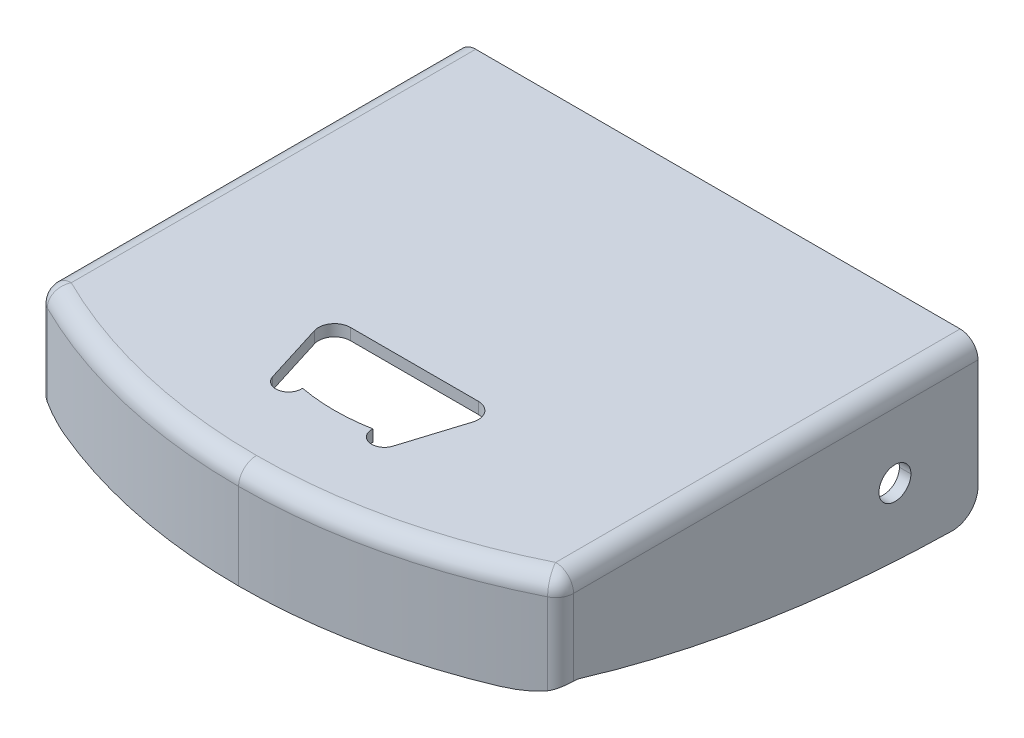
ISO-10303-21;
HEADER;
FILE_DESCRIPTION(('STEP AP214'),'2;1');
FILE_NAME('part.step','',(''),(''),'','','');
FILE_SCHEMA(('AUTOMOTIVE_DESIGN { 1 0 10303 214 1 1 1 1 }'));
ENDSEC;
DATA;
#1=APPLICATION_CONTEXT('core data for automotive mechanical design processes');
#2=APPLICATION_PROTOCOL_DEFINITION('international standard','automotive_design',2000,#1);
#3=PRODUCT_CONTEXT('',#1,'mechanical');
#4=PRODUCT('Part','Part','',(#3));
#5=PRODUCT_RELATED_PRODUCT_CATEGORY('part','',(#4));
#6=PRODUCT_DEFINITION_FORMATION('','',#4);
#7=PRODUCT_DEFINITION_CONTEXT('part definition',#1,'design');
#8=PRODUCT_DEFINITION('design','',#6,#7);
#9=PRODUCT_DEFINITION_SHAPE('','',#8);
#10=(LENGTH_UNIT() NAMED_UNIT(*) SI_UNIT(.MILLI.,.METRE.));
#11=(NAMED_UNIT(*) PLANE_ANGLE_UNIT() SI_UNIT($,.RADIAN.));
#12=(NAMED_UNIT(*) SI_UNIT($,.STERADIAN.) SOLID_ANGLE_UNIT());
#13=UNCERTAINTY_MEASURE_WITH_UNIT(LENGTH_MEASURE(1.E-05),#10,'distance_accuracy_value','');
#14=(GEOMETRIC_REPRESENTATION_CONTEXT(3) GLOBAL_UNCERTAINTY_ASSIGNED_CONTEXT((#13)) GLOBAL_UNIT_ASSIGNED_CONTEXT((#10,
#11,#12)) REPRESENTATION_CONTEXT('',''));
#15=CARTESIAN_POINT('',(0.,0.,0.));
#16=DIRECTION('',(0.,0.,1.));
#17=DIRECTION('',(1.,0.,0.));
#18=AXIS2_PLACEMENT_3D('',#15,#16,#17);
#19=CARTESIAN_POINT('',(9.40906954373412,-1.8,60.2786575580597));
#20=DIRECTION('',(0.954534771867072,0.,0.298099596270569));
#21=DIRECTION('',(0.,-1.,0.));
#22=AXIS2_PLACEMENT_3D('',#19,#20,#21);
#23=PLANE('',#22);
#24=DIRECTION('',(0.298099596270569,0.,-0.954534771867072));
#25=VECTOR('',#24,1.);
#26=CARTESIAN_POINT('',(9.40906954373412,0.,60.2786575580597));
#27=LINE('',#26,#25);
#28=CARTESIAN_POINT('',(9.40906954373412,0.,60.2786575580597));
#29=VERTEX_POINT('',#28);
#30=CARTESIAN_POINT('',(12.3863369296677,0.,50.7452489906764));
#31=VERTEX_POINT('',#30);
#32=EDGE_CURVE('E357',#29,#31,#27,.T.);
#33=ORIENTED_EDGE('',*,*,#32,.T.);
#34=DIRECTION('',(0.,1.,0.));
#35=VECTOR('',#34,1.);
#36=CARTESIAN_POINT('',(12.3863369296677,-1.8,50.7452489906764));
#37=LINE('',#36,#35);
#38=CARTESIAN_POINT('',(12.3863369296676,-1.8,50.7452489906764));
#39=VERTEX_POINT('',#38);
#40=EDGE_CURVE('E10',#39,#31,#37,.T.);
#41=ORIENTED_EDGE('',*,*,#40,.F.);
#42=DIRECTION('',(0.298099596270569,0.,-0.954534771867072));
#43=VECTOR('',#42,1.);
#44=CARTESIAN_POINT('',(9.40906954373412,-1.8,60.2786575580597));
#45=LINE('',#44,#43);
#46=CARTESIAN_POINT('',(9.40906954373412,-1.8,60.2786575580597));
#47=VERTEX_POINT('',#46);
#48=EDGE_CURVE('E524',#47,#39,#45,.T.);
#49=ORIENTED_EDGE('',*,*,#48,.F.);
#50=DIRECTION('',(0.,1.,0.));
#51=VECTOR('',#50,1.);
#52=CARTESIAN_POINT('',(9.40906954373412,-1.8,60.2786575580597));
#53=LINE('',#52,#51);
#54=EDGE_CURVE('E359',#47,#29,#53,.T.);
#55=ORIENTED_EDGE('',*,*,#54,.T.);
#56=EDGE_LOOP('',(#33,#41,#49,#55));
#57=FACE_BOUND('',#56,.T.);
#58=ADVANCED_FACE('F15',(#57),#23,.F.);
#59=CARTESIAN_POINT('',(10.,-1.8,50.));
#60=DIRECTION('',(0.,1.,0.));
#61=DIRECTION('',(0.,0.,1.));
#62=AXIS2_PLACEMENT_3D('',#59,#60,#61);
#63=CYLINDRICAL_SURFACE('',#62,2.5);
#64=CARTESIAN_POINT('',(10.,0.,50.));
#65=DIRECTION('',(0.,1.,0.));
#66=DIRECTION('',(0.,0.,-1.));
#67=AXIS2_PLACEMENT_3D('',#64,#65,#66);
#68=CIRCLE('',#67,2.5);
#69=CARTESIAN_POINT('',(10.,0.,47.5));
#70=VERTEX_POINT('',#69);
#71=EDGE_CURVE('E350',#31,#70,#68,.T.);
#72=ORIENTED_EDGE('',*,*,#71,.T.);
#73=DIRECTION('',(0.,1.,0.));
#74=VECTOR('',#73,1.);
#75=CARTESIAN_POINT('',(10.,-1.8,47.5));
#76=LINE('',#75,#74);
#77=CARTESIAN_POINT('',(10.,-1.8,47.5));
#78=VERTEX_POINT('',#77);
#79=EDGE_CURVE('E29',#78,#70,#76,.T.);
#80=ORIENTED_EDGE('',*,*,#79,.F.);
#81=CARTESIAN_POINT('',(10.,-1.8,50.));
#82=DIRECTION('',(0.,1.,0.));
#83=DIRECTION('',(0.,0.,-1.));
#84=AXIS2_PLACEMENT_3D('',#81,#82,#83);
#85=CIRCLE('',#84,2.5);
#86=EDGE_CURVE('E353',#39,#78,#85,.T.);
#87=ORIENTED_EDGE('',*,*,#86,.F.);
#88=ORIENTED_EDGE('',*,*,#40,.T.);
#89=EDGE_LOOP('',(#72,#80,#87,#88));
#90=FACE_BOUND('',#89,.T.);
#91=ADVANCED_FACE('F348',(#90),#63,.F.);
#92=CARTESIAN_POINT('',(-10.,-1.8,47.5));
#93=DIRECTION('',(0.,0.,-1.));
#94=DIRECTION('',(0.,-1.,0.));
#95=AXIS2_PLACEMENT_3D('',#92,#93,#94);
#96=PLANE('',#95);
#97=DIRECTION('',(-1.,0.,0.));
#98=VECTOR('',#97,1.);
#99=CARTESIAN_POINT('',(-10.,0.,47.5));
#100=LINE('',#99,#98);
#101=CARTESIAN_POINT('',(-10.,0.,47.5));
#102=VERTEX_POINT('',#101);
#103=EDGE_CURVE('E371',#70,#102,#100,.T.);
#104=ORIENTED_EDGE('',*,*,#103,.T.);
#105=DIRECTION('',(0.,1.,0.));
#106=VECTOR('',#105,1.);
#107=CARTESIAN_POINT('',(-10.,-1.8,47.5));
#108=LINE('',#107,#106);
#109=CARTESIAN_POINT('',(-10.,-1.8,47.5));
#110=VERTEX_POINT('',#109);
#111=EDGE_CURVE('E519',#110,#102,#108,.T.);
#112=ORIENTED_EDGE('',*,*,#111,.F.);
#113=DIRECTION('',(-1.,0.,0.));
#114=VECTOR('',#113,1.);
#115=CARTESIAN_POINT('',(-10.,-1.8,47.5));
#116=LINE('',#115,#114);
#117=EDGE_CURVE('E435',#78,#110,#116,.T.);
#118=ORIENTED_EDGE('',*,*,#117,.F.);
#119=ORIENTED_EDGE('',*,*,#79,.T.);
#120=EDGE_LOOP('',(#104,#112,#118,#119));
#121=FACE_BOUND('',#120,.T.);
#122=ADVANCED_FACE('F1170',(#121),#96,.F.);
#123=CARTESIAN_POINT('',(-10.,-1.8,50.));
#124=DIRECTION('',(0.,1.,0.));
#125=DIRECTION('',(0.,0.,1.));
#126=AXIS2_PLACEMENT_3D('',#123,#124,#125);
#127=CYLINDRICAL_SURFACE('',#126,2.5);
#128=CARTESIAN_POINT('',(-10.,0.,50.));
#129=DIRECTION('',(0.,1.,0.));
#130=DIRECTION('',(0.,0.,1.));
#131=AXIS2_PLACEMENT_3D('',#128,#129,#130);
#132=CIRCLE('',#131,2.5);
#133=CARTESIAN_POINT('',(-12.3863369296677,0.,50.7452489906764));
#134=VERTEX_POINT('',#133);
#135=EDGE_CURVE('E378',#102,#134,#132,.T.);
#136=ORIENTED_EDGE('',*,*,#135,.T.);
#137=DIRECTION('',(0.,1.,0.));
#138=VECTOR('',#137,1.);
#139=CARTESIAN_POINT('',(-12.3863369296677,-1.8,50.7452489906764));
#140=LINE('',#139,#138);
#141=CARTESIAN_POINT('',(-12.3863369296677,-1.8,50.7452489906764));
#142=VERTEX_POINT('',#141);
#143=EDGE_CURVE('E405',#142,#134,#140,.T.);
#144=ORIENTED_EDGE('',*,*,#143,.F.);
#145=CARTESIAN_POINT('',(-10.,-1.8,50.));
#146=DIRECTION('',(0.,1.,0.));
#147=DIRECTION('',(0.,0.,1.));
#148=AXIS2_PLACEMENT_3D('',#145,#146,#147);
#149=CIRCLE('',#148,2.5);
#150=EDGE_CURVE('E430',#110,#142,#149,.T.);
#151=ORIENTED_EDGE('',*,*,#150,.F.);
#152=ORIENTED_EDGE('',*,*,#111,.T.);
#153=EDGE_LOOP('',(#136,#144,#151,#152));
#154=FACE_BOUND('',#153,.T.);
#155=ADVANCED_FACE('F1043',(#154),#127,.F.);
#156=CARTESIAN_POINT('',(-9.40906954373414,-1.8,60.2786575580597));
#157=DIRECTION('',(-0.954534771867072,0.,0.298099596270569));
#158=DIRECTION('',(0.,1.,0.));
#159=AXIS2_PLACEMENT_3D('',#156,#157,#158);
#160=PLANE('',#159);
#161=DIRECTION('',(0.298099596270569,0.,0.954534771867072));
#162=VECTOR('',#161,1.);
#163=CARTESIAN_POINT('',(-9.40906954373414,0.,60.2786575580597));
#164=LINE('',#163,#162);
#165=CARTESIAN_POINT('',(-9.40906954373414,0.,60.2786575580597));
#166=VERTEX_POINT('',#165);
#167=EDGE_CURVE('E661',#134,#166,#164,.T.);
#168=ORIENTED_EDGE('',*,*,#167,.T.);
#169=DIRECTION('',(0.,1.,0.));
#170=VECTOR('',#169,1.);
#171=CARTESIAN_POINT('',(-9.40906954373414,-1.8,60.2786575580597));
#172=LINE('',#171,#170);
#173=CARTESIAN_POINT('',(-9.40906954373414,-1.8,60.2786575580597));
#174=VERTEX_POINT('',#173);
#175=EDGE_CURVE('E402',#174,#166,#172,.T.);
#176=ORIENTED_EDGE('',*,*,#175,.F.);
#177=DIRECTION('',(0.298099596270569,0.,0.954534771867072));
#178=VECTOR('',#177,1.);
#179=CARTESIAN_POINT('',(-9.40906954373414,-1.8,60.2786575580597));
#180=LINE('',#179,#178);
#181=EDGE_CURVE('E434',#142,#174,#180,.T.);
#182=ORIENTED_EDGE('',*,*,#181,.F.);
#183=ORIENTED_EDGE('',*,*,#143,.T.);
#184=EDGE_LOOP('',(#168,#176,#182,#183));
#185=FACE_BOUND('',#184,.T.);
#186=ADVANCED_FACE('F1012',(#185),#160,.F.);
#187=CARTESIAN_POINT('',(-7.5,-1.8,59.6824583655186));
#188=DIRECTION('',(0.,1.,0.));
#189=DIRECTION('',(0.,0.,1.));
#190=AXIS2_PLACEMENT_3D('',#187,#188,#189);
#191=CYLINDRICAL_SURFACE('',#190,2.);
#192=DIRECTION('',(0.,1.,0.));
#193=VECTOR('',#192,1.);
#194=CARTESIAN_POINT('',(-7.5,-1.8,61.6824583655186));
#195=LINE('',#194,#193);
#196=CARTESIAN_POINT('',(-7.5,-1.8,61.6824583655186));
#197=VERTEX_POINT('',#196);
#198=CARTESIAN_POINT('',(-7.5,0.,61.6824583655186));
#199=VERTEX_POINT('',#198);
#200=EDGE_CURVE('E479',#197,#199,#195,.T.);
#201=ORIENTED_EDGE('',*,*,#200,.F.);
#202=CARTESIAN_POINT('',(-7.5,-1.8,59.6824583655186));
#203=DIRECTION('',(0.,1.,0.));
#204=DIRECTION('',(0.,0.,1.));
#205=AXIS2_PLACEMENT_3D('',#202,#203,#204);
#206=CIRCLE('',#205,2.);
#207=EDGE_CURVE('E725',#174,#197,#206,.T.);
#208=ORIENTED_EDGE('',*,*,#207,.F.);
#209=ORIENTED_EDGE('',*,*,#175,.T.);
#210=CARTESIAN_POINT('',(-7.5,0.,59.6824583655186));
#211=DIRECTION('',(0.,1.,0.));
#212=DIRECTION('',(0.,0.,1.));
#213=AXIS2_PLACEMENT_3D('',#210,#211,#212);
#214=CIRCLE('',#213,2.);
#215=EDGE_CURVE('E533',#166,#199,#214,.T.);
#216=ORIENTED_EDGE('',*,*,#215,.T.);
#217=EDGE_LOOP('',(#201,#208,#209,#216));
#218=FACE_BOUND('',#217,.T.);
#219=ADVANCED_FACE('F1599',(#218),#191,.F.);
#220=CARTESIAN_POINT('',(0.,-1.8,30.));
#221=DIRECTION('',(0.,1.,0.));
#222=DIRECTION('',(0.,0.,1.));
#223=AXIS2_PLACEMENT_3D('',#220,#221,#222);
#224=CYLINDRICAL_SURFACE('',#223,30.);
#225=DIRECTION('',(0.,1.,0.));
#226=VECTOR('',#225,1.);
#227=CARTESIAN_POINT('',(0.,-1.8,60.));
#228=LINE('',#227,#226);
#229=CARTESIAN_POINT('',(0.,-1.8,60.));
#230=VERTEX_POINT('',#229);
#231=CARTESIAN_POINT('',(0.,0.,60.));
#232=VERTEX_POINT('',#231);
#233=EDGE_CURVE('E617',#230,#232,#228,.T.);
#234=ORIENTED_EDGE('',*,*,#233,.F.);
#235=CARTESIAN_POINT('',(0.,-1.8,30.));
#236=DIRECTION('',(0.,1.,0.));
#237=DIRECTION('',(0.,0.,1.));
#238=AXIS2_PLACEMENT_3D('',#235,#236,#237);
#239=CIRCLE('',#238,30.);
#240=CARTESIAN_POINT('',(-5.50930210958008,-1.8,59.4897878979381));
#241=VERTEX_POINT('',#240);
#242=EDGE_CURVE('E488',#241,#230,#239,.T.);
#243=ORIENTED_EDGE('',*,*,#242,.F.);
#244=DIRECTION('',(0.,1.,0.));
#245=VECTOR('',#244,1.);
#246=CARTESIAN_POINT('',(-5.50930210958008,-1.8,59.4897878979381));
#247=LINE('',#246,#245);
#248=CARTESIAN_POINT('',(-5.50930210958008,0.,59.4897878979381));
#249=VERTEX_POINT('',#248);
#250=EDGE_CURVE('E489',#241,#249,#247,.T.);
#251=ORIENTED_EDGE('',*,*,#250,.T.);
#252=CARTESIAN_POINT('',(0.,0.,30.));
#253=DIRECTION('',(0.,1.,0.));
#254=DIRECTION('',(0.,0.,1.));
#255=AXIS2_PLACEMENT_3D('',#252,#253,#254);
#256=CIRCLE('',#255,30.);
#257=EDGE_CURVE('E530',#249,#232,#256,.T.);
#258=ORIENTED_EDGE('',*,*,#257,.T.);
#259=EDGE_LOOP('',(#234,#243,#251,#258));
#260=FACE_BOUND('',#259,.T.);
#261=ADVANCED_FACE('F1594',(#260),#224,.F.);
#262=CARTESIAN_POINT('',(7.5,-1.8,59.6824583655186));
#263=DIRECTION('',(0.,1.,0.));
#264=DIRECTION('',(0.,0.,1.));
#265=AXIS2_PLACEMENT_3D('',#262,#263,#264);
#266=CYLINDRICAL_SURFACE('',#265,2.);
#267=DIRECTION('',(0.,1.,0.));
#268=VECTOR('',#267,1.);
#269=CARTESIAN_POINT('',(7.5,-1.8,61.6824583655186));
#270=LINE('',#269,#268);
#271=CARTESIAN_POINT('',(7.5,-1.8,61.6824583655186));
#272=VERTEX_POINT('',#271);
#273=CARTESIAN_POINT('',(7.5,0.,61.6824583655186));
#274=VERTEX_POINT('',#273);
#275=EDGE_CURVE('E507',#272,#274,#270,.T.);
#276=ORIENTED_EDGE('',*,*,#275,.F.);
#277=CARTESIAN_POINT('',(7.5,-1.8,59.6824583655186));
#278=DIRECTION('',(0.,1.,0.));
#279=DIRECTION('',(0.,0.,-1.));
#280=AXIS2_PLACEMENT_3D('',#277,#278,#279);
#281=CIRCLE('',#280,2.);
#282=CARTESIAN_POINT('',(5.50930210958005,-1.8,59.4897878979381));
#283=VERTEX_POINT('',#282);
#284=EDGE_CURVE('E628',#283,#272,#281,.T.);
#285=ORIENTED_EDGE('',*,*,#284,.F.);
#286=DIRECTION('',(0.,1.,0.));
#287=VECTOR('',#286,1.);
#288=CARTESIAN_POINT('',(5.50930210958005,-1.8,59.4897878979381));
#289=LINE('',#288,#287);
#290=CARTESIAN_POINT('',(5.50930210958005,0.,59.4897878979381));
#291=VERTEX_POINT('',#290);
#292=EDGE_CURVE('E390',#283,#291,#289,.T.);
#293=ORIENTED_EDGE('',*,*,#292,.T.);
#294=CARTESIAN_POINT('',(7.5,0.,59.6824583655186));
#295=DIRECTION('',(0.,1.,0.));
#296=DIRECTION('',(0.,0.,-1.));
#297=AXIS2_PLACEMENT_3D('',#294,#295,#296);
#298=CIRCLE('',#297,2.);
#299=EDGE_CURVE('E474',#291,#274,#298,.T.);
#300=ORIENTED_EDGE('',*,*,#299,.T.);
#301=EDGE_LOOP('',(#276,#285,#293,#300));
#302=FACE_BOUND('',#301,.T.);
#303=ADVANCED_FACE('F1598',(#302),#266,.F.);
#304=CARTESIAN_POINT('',(40.7,-13.,13.));
#305=DIRECTION('',(-1.,0.,0.));
#306=DIRECTION('',(0.,0.,1.));
#307=AXIS2_PLACEMENT_3D('',#304,#305,#306);
#308=CYLINDRICAL_SURFACE('',#307,2.5);
#309=DIRECTION('',(-1.,0.,0.));
#310=VECTOR('',#309,1.);
#311=CARTESIAN_POINT('',(40.7,-13.,10.5));
#312=LINE('',#311,#310);
#313=CARTESIAN_POINT('',(40.7,-13.,10.5));
#314=VERTEX_POINT('',#313);
#315=CARTESIAN_POINT('',(38.9,-13.,10.5));
#316=VERTEX_POINT('',#315);
#317=EDGE_CURVE('E455',#314,#316,#312,.T.);
#318=ORIENTED_EDGE('',*,*,#317,.F.);
#319=CARTESIAN_POINT('',(40.7,-13.,13.));
#320=DIRECTION('',(-1.,0.,0.));
#321=DIRECTION('',(0.,0.,1.));
#322=AXIS2_PLACEMENT_3D('',#319,#320,#321);
#323=CIRCLE('',#322,2.5);
#324=CARTESIAN_POINT('',(40.7,-13.,15.5));
#325=VERTEX_POINT('',#324);
#326=EDGE_CURVE('E416',#325,#314,#323,.T.);
#327=ORIENTED_EDGE('',*,*,#326,.F.);
#328=DIRECTION('',(-1.,0.,0.));
#329=VECTOR('',#328,1.);
#330=CARTESIAN_POINT('',(40.7,-13.,15.5));
#331=LINE('',#330,#329);
#332=CARTESIAN_POINT('',(38.9,-13.,15.5));
#333=VERTEX_POINT('',#332);
#334=EDGE_CURVE('E572',#325,#333,#331,.T.);
#335=ORIENTED_EDGE('',*,*,#334,.T.);
#336=CARTESIAN_POINT('',(38.9,-13.,13.));
#337=DIRECTION('',(1.,0.,0.));
#338=DIRECTION('',(0.,0.,-1.));
#339=AXIS2_PLACEMENT_3D('',#336,#337,#338);
#340=CIRCLE('',#339,2.5);
#341=EDGE_CURVE('E642',#316,#333,#340,.T.);
#342=ORIENTED_EDGE('',*,*,#341,.F.);
#343=EDGE_LOOP('',(#318,#327,#335,#342));
#344=FACE_BOUND('',#343,.T.);
#345=ADVANCED_FACE('F791',(#344),#308,.F.);
#346=CARTESIAN_POINT('',(40.7,-13.,13.));
#347=DIRECTION('',(-1.,0.,0.));
#348=DIRECTION('',(0.,0.,1.));
#349=AXIS2_PLACEMENT_3D('',#346,#347,#348);
#350=CYLINDRICAL_SURFACE('',#349,2.5);
#351=DIRECTION('',(-1.,0.,0.));
#352=VECTOR('',#351,1.);
#353=CARTESIAN_POINT('',(40.7,-13.,10.5));
#354=LINE('',#353,#352);
#355=CARTESIAN_POINT('',(-38.9,-13.,10.5));
#356=VERTEX_POINT('',#355);
#357=CARTESIAN_POINT('',(-40.7,-13.,10.5));
#358=VERTEX_POINT('',#357);
#359=EDGE_CURVE('E555',#356,#358,#354,.T.);
#360=ORIENTED_EDGE('',*,*,#359,.F.);
#361=CARTESIAN_POINT('',(-38.9,-13.,13.));
#362=DIRECTION('',(-1.,0.,0.));
#363=DIRECTION('',(0.,0.,1.));
#364=AXIS2_PLACEMENT_3D('',#361,#362,#363);
#365=CIRCLE('',#364,2.5);
#366=CARTESIAN_POINT('',(-38.9,-13.,15.5));
#367=VERTEX_POINT('',#366);
#368=EDGE_CURVE('E654',#367,#356,#365,.T.);
#369=ORIENTED_EDGE('',*,*,#368,.F.);
#370=DIRECTION('',(-1.,0.,0.));
#371=VECTOR('',#370,1.);
#372=CARTESIAN_POINT('',(40.7,-13.,15.5));
#373=LINE('',#372,#371);
#374=CARTESIAN_POINT('',(-40.7,-13.,15.5));
#375=VERTEX_POINT('',#374);
#376=EDGE_CURVE('E478',#367,#375,#373,.T.);
#377=ORIENTED_EDGE('',*,*,#376,.T.);
#378=CARTESIAN_POINT('',(-40.7,-13.,13.));
#379=DIRECTION('',(-1.,0.,0.));
#380=DIRECTION('',(0.,0.,1.));
#381=AXIS2_PLACEMENT_3D('',#378,#379,#380);
#382=CIRCLE('',#381,2.5);
#383=EDGE_CURVE('E469',#375,#358,#382,.T.);
#384=ORIENTED_EDGE('',*,*,#383,.T.);
#385=EDGE_LOOP('',(#360,#369,#377,#384));
#386=FACE_BOUND('',#385,.T.);
#387=ADVANCED_FACE('F787',(#386),#350,.F.);
#388=CARTESIAN_POINT('',(40.7,-12.3041888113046,68.1617642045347));
#389=DIRECTION('',(1.,0.,0.));
#390=DIRECTION('',(0.,0.,-1.));
#391=AXIS2_PLACEMENT_3D('',#388,#389,#390);
#392=CYLINDRICAL_SURFACE('',#391,4.);
#393=CARTESIAN_POINT('',(-39.2206392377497,-15.4988366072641,65.7546444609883));
#394=CARTESIAN_POINT('',(-39.196750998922,-15.5084643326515,65.7674220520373));
#395=CARTESIAN_POINT('',(-39.1725669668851,-15.5177549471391,65.7799117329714));
#396=CARTESIAN_POINT('',(-39.1481108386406,-15.5267101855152,65.792089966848));
#397=(BOUNDED_CURVE() B_SPLINE_CURVE(3,(#393,#394,#395,#396),.UNSPECIFIED.,.F.,
.F.) B_SPLINE_CURVE_WITH_KNOTS((4,4),(0.,8.62523677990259E-05),
.UNSPECIFIED.) CURVE() GEOMETRIC_REPRESENTATION_ITEM() RATIONAL_B_SPLINE_CURVE((1.,1.,1.,1.)) REPRESENTATION_ITEM(''));
#398=CARTESIAN_POINT('',(-39.2206392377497,-15.4988366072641,65.7546444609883));
#399=VERTEX_POINT('',#398);
#400=CARTESIAN_POINT('',(-39.1481108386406,-15.5267101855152,65.792089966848));
#401=VERTEX_POINT('',#400);
#402=EDGE_CURVE('E44',#399,#401,#397,.T.);
#403=ORIENTED_EDGE('',*,*,#402,.F.);
#404=DIRECTION('',(-1.,0.,0.));
#405=VECTOR('',#404,1.);
#406=CARTESIAN_POINT('',(40.7,-15.4988366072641,65.7546444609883));
#407=LINE('',#406,#405);
#408=CARTESIAN_POINT('',(-35.0076085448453,-15.4988366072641,65.7546444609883));
#409=VERTEX_POINT('',#408);
#410=EDGE_CURVE('E976',#409,#399,#407,.T.);
#411=ORIENTED_EDGE('',*,*,#410,.F.);
#412=CARTESIAN_POINT('',(-29.0075785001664,-16.3041888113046,68.1617642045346));
#413=CARTESIAN_POINT('',(-29.2766151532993,-16.3041722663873,68.0654026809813));
#414=CARTESIAN_POINT('',(-29.5451899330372,-16.3007328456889,67.9676904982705));
#415=CARTESIAN_POINT('',(-30.0726401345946,-16.286467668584,67.7728160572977));
#416=CARTESIAN_POINT('',(-30.3315522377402,-16.2758804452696,67.6757352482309));
#417=CARTESIAN_POINT('',(-30.8397549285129,-16.2473323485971,67.4823841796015));
#418=CARTESIAN_POINT('',(-31.0890873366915,-16.2296193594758,67.3861881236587));
#419=CARTESIAN_POINT('',(-31.5781888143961,-16.18679294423,67.1948682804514));
#420=CARTESIAN_POINT('',(-31.8180062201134,-16.1619375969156,67.0998105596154));
#421=CARTESIAN_POINT('',(-32.3279970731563,-16.1000227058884,66.8950112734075));
#422=CARTESIAN_POINT('',(-32.5979252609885,-16.061772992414,66.7850110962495));
#423=CARTESIAN_POINT('',(-33.1216015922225,-15.9751499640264,66.5685121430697));
#424=CARTESIAN_POINT('',(-33.3754877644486,-15.9273734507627,66.4621106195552));
#425=CARTESIAN_POINT('',(-33.8672375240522,-15.8216647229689,66.2532619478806));
#426=CARTESIAN_POINT('',(-34.1052644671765,-15.7643645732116,66.1508852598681));
#427=CARTESIAN_POINT('',(-34.5653468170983,-15.6395071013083,65.9505685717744));
#428=CARTESIAN_POINT('',(-34.7876006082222,-15.5726161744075,65.8526664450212));
#429=CARTESIAN_POINT('',(-35.0076085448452,-15.4988366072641,65.7546444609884));
#430=B_SPLINE_CURVE_WITH_KNOTS('',3,(#412,#413,#414,#415,#416,#417,#418,#419,#420,#421,#422,
#423,#424,#425,#426,#427,#428,#429),.UNSPECIFIED.,.F.,.F.,(4,2,2,2,2,2,2,2,4),(0.,
0.857325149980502,1.6873682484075,2.49073801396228,3.26810583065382,4.14979675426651,
4.98771966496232,5.78347522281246,6.5389321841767),.UNSPECIFIED.);
#431=CARTESIAN_POINT('',(-29.0075785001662,-16.3041888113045,68.1617642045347));
#432=VERTEX_POINT('',#431);
#433=EDGE_CURVE('E1027',#432,#409,#430,.T.);
#434=ORIENTED_EDGE('',*,*,#433,.F.);
#435=DIRECTION('',(1.,0.,0.));
#436=VECTOR('',#435,1.);
#437=CARTESIAN_POINT('',(-33.1515642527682,-16.3041888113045,68.1617642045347));
#438=LINE('',#437,#436);
#439=CARTESIAN_POINT('',(-33.9759887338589,-16.3041888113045,68.1617642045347));
#440=VERTEX_POINT('',#439);
#441=EDGE_CURVE('E406',#440,#432,#438,.T.);
#442=ORIENTED_EDGE('',*,*,#441,.F.);
#443=CARTESIAN_POINT('',(-39.1481108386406,-15.5267101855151,65.792089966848));
#444=CARTESIAN_POINT('',(-38.9571162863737,-15.5966050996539,65.8872034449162));
#445=CARTESIAN_POINT('',(-38.764043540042,-15.6603410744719,65.9824728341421));
#446=CARTESIAN_POINT('',(-38.365649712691,-15.7793905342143,66.1772141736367));
#447=CARTESIAN_POINT('',(-38.1601710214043,-15.8341888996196,66.2766801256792));
#448=CARTESIAN_POINT('',(-37.7368720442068,-15.9353860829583,66.4795286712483));
#449=CARTESIAN_POINT('',(-37.5189188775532,-15.9812824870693,66.5828809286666));
#450=CARTESIAN_POINT('',(-37.0705113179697,-16.064662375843,66.7932372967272));
#451=CARTESIAN_POINT('',(-36.8399435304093,-16.1016609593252,66.900190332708));
#452=CARTESIAN_POINT('',(-36.4002807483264,-16.162475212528,67.1018084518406));
#453=CARTESIAN_POINT('',(-36.1913823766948,-16.18724794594,67.1966186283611));
#454=CARTESIAN_POINT('',(-35.7666499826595,-16.2298828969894,67.3873767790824));
#455=CARTESIAN_POINT('',(-35.5507792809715,-16.2475437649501,67.4832879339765));
#456=CARTESIAN_POINT('',(-35.1120507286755,-16.2759643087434,67.6760939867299));
#457=CARTESIAN_POINT('',(-34.8891613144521,-16.2865252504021,67.7729457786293));
#458=CARTESIAN_POINT('',(-34.4363276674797,-16.3007308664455,67.967483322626));
#459=CARTESIAN_POINT('',(-34.2063562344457,-16.3041799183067,68.0651202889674));
#460=CARTESIAN_POINT('',(-33.9759887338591,-16.3041888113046,68.1617642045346));
#461=B_SPLINE_CURVE_WITH_KNOTS('',3,(#443,#444,#445,#446,#447,#448,#449,#450,#451,#452,#453,
#454,#455,#456,#457,#458,#459,#460),.UNSPECIFIED.,.F.,.F.,(4,2,2,2,2,2,2,2,4),(0.,
0.673355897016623,1.37734696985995,2.11372589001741,2.88402427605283,3.57611474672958,
4.28661497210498,5.01625593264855,5.76571260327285),.UNSPECIFIED.);
#462=EDGE_CURVE('E1059',#401,#440,#461,.T.);
#463=ORIENTED_EDGE('',*,*,#462,.F.);
#464=EDGE_LOOP('',(#403,#411,#434,#442,#463));
#465=FACE_BOUND('',#464,.T.);
#466=ADVANCED_FACE('F790',(#465),#392,.T.);
#467=CARTESIAN_POINT('',(40.7,-12.3041888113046,68.1617642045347));
#468=DIRECTION('',(1.,0.,0.));
#469=DIRECTION('',(0.,0.,-1.));
#470=AXIS2_PLACEMENT_3D('',#467,#468,#469);
#471=CYLINDRICAL_SURFACE('',#470,4.);
#472=CARTESIAN_POINT('',(35.0076085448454,-15.4988366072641,65.7546444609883));
#473=CARTESIAN_POINT('',(34.7876049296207,-15.5726146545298,65.8526645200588));
#474=CARTESIAN_POINT('',(34.5653554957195,-15.6395040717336,65.9505647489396));
#475=CARTESIAN_POINT('',(34.1052790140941,-15.7643596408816,66.150878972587));
#476=CARTESIAN_POINT('',(33.8672535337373,-15.8216592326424,66.2532550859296));
#477=CARTESIAN_POINT('',(33.375503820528,-15.9273679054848,66.4621038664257));
#478=CARTESIAN_POINT('',(33.1216161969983,-15.9751447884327,66.5685060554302));
#479=CARTESIAN_POINT('',(32.5979340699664,-16.0617699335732,66.7850075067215));
#480=CARTESIAN_POINT('',(32.3280015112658,-16.1000213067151,66.8950094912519));
#481=CARTESIAN_POINT('',(31.8180126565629,-16.1619375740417,67.0998079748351));
#482=CARTESIAN_POINT('',(31.5782017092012,-16.1867930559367,67.1948631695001));
#483=CARTESIAN_POINT('',(31.0891088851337,-16.2296196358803,67.3861797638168));
#484=CARTESIAN_POINT('',(30.8397786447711,-16.2473324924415,67.4823750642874));
#485=CARTESIAN_POINT('',(30.3315760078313,-16.2758805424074,67.6757262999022));
#486=CARTESIAN_POINT('',(30.0726617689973,-16.2864677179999,67.7728079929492));
#487=CARTESIAN_POINT('',(29.5452029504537,-16.300732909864,67.9676857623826));
#488=CARTESIAN_POINT('',(29.2766216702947,-16.3041722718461,68.0654003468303));
#489=CARTESIAN_POINT('',(29.0075785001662,-16.3041888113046,68.1617642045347));
#490=B_SPLINE_CURVE_WITH_KNOTS('',3,(#472,#473,#474,#475,#476,#477,#478,#479,#480,#481,#482,
#483,#484,#485,#486,#487,#488,#489),.UNSPECIFIED.,.F.,.F.,(4,2,2,2,2,2,2,2,4),(0.,
0.755442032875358,1.55119262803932,2.38912047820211,3.27082613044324,4.04817326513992,
4.85153611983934,5.68158613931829,6.53893206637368),.UNSPECIFIED.);
#491=CARTESIAN_POINT('',(35.0076085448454,-15.4988366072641,65.7546444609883));
#492=VERTEX_POINT('',#491);
#493=CARTESIAN_POINT('',(29.0075785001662,-16.3041888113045,68.1617642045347));
#494=VERTEX_POINT('',#493);
#495=EDGE_CURVE('E916',#492,#494,#490,.T.);
#496=ORIENTED_EDGE('',*,*,#495,.F.);
#497=DIRECTION('',(-1.,0.,0.));
#498=VECTOR('',#497,1.);
#499=CARTESIAN_POINT('',(40.7,-15.4988366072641,65.7546444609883));
#500=LINE('',#499,#498);
#501=CARTESIAN_POINT('',(39.2206392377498,-15.4988366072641,65.7546444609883));
#502=VERTEX_POINT('',#501);
#503=EDGE_CURVE('E914',#502,#492,#500,.T.);
#504=ORIENTED_EDGE('',*,*,#503,.F.);
#505=CARTESIAN_POINT('',(39.1481108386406,-15.5267101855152,65.792089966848));
#506=CARTESIAN_POINT('',(39.1725669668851,-15.5177549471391,65.7799117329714));
#507=CARTESIAN_POINT('',(39.1967509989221,-15.5084643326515,65.7674220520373));
#508=CARTESIAN_POINT('',(39.2206392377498,-15.4988366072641,65.7546444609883));
#509=(BOUNDED_CURVE() B_SPLINE_CURVE(3,(#505,#506,#507,#508),.UNSPECIFIED.,.F.,
.F.) B_SPLINE_CURVE_WITH_KNOTS((4,4),(0.,8.62523677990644E-05),
.UNSPECIFIED.) CURVE() GEOMETRIC_REPRESENTATION_ITEM() RATIONAL_B_SPLINE_CURVE((1.,1.,1.,1.)) REPRESENTATION_ITEM(''));
#510=CARTESIAN_POINT('',(39.1481108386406,-15.5267101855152,65.792089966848));
#511=VERTEX_POINT('',#510);
#512=EDGE_CURVE('E586',#511,#502,#509,.T.);
#513=ORIENTED_EDGE('',*,*,#512,.F.);
#514=CARTESIAN_POINT('',(33.9759887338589,-16.3041888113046,68.1617642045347));
#515=CARTESIAN_POINT('',(34.2063499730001,-16.3041799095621,68.0651229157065));
#516=CARTESIAN_POINT('',(34.4363151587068,-16.3007307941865,67.9674886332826));
#517=CARTESIAN_POINT('',(34.8891405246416,-16.2865251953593,67.7729547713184));
#518=CARTESIAN_POINT('',(35.1120278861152,-16.275964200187,67.6761039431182));
#519=CARTESIAN_POINT('',(35.5507564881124,-16.247543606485,67.4832980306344));
#520=CARTESIAN_POINT('',(35.766629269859,-16.2298825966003,67.3873860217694));
#521=CARTESIAN_POINT('',(36.1913699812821,-16.1872478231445,67.1966242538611));
#522=CARTESIAN_POINT('',(36.4002745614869,-16.1624752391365,67.1018112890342));
#523=CARTESIAN_POINT('',(36.8399390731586,-16.101662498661,66.9001923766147));
#524=CARTESIAN_POINT('',(37.0705024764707,-16.0646657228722,66.7932413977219));
#525=CARTESIAN_POINT('',(37.5189042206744,-15.9812881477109,66.5828878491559));
#526=CARTESIAN_POINT('',(37.736855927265,-15.9353921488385,66.4795363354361));
#527=CARTESIAN_POINT('',(38.160154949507,-15.834194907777,66.2766878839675));
#528=CARTESIAN_POINT('',(38.3656351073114,-15.7793959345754,66.1772212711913));
#529=CARTESIAN_POINT('',(38.7640348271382,-15.6603443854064,65.982477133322));
#530=CARTESIAN_POINT('',(38.9571119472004,-15.5966067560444,65.8872056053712));
#531=CARTESIAN_POINT('',(39.1481108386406,-15.5267101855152,65.792089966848));
#532=B_SPLINE_CURVE_WITH_KNOTS('',3,(#514,#515,#516,#517,#518,#519,#520,#521,#522,#523,#524,
#525,#526,#527,#528,#529,#530,#531),.UNSPECIFIED.,.F.,.F.,(4,2,2,2,2,2,2,2,4),(0.,
0.749436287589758,1.47907045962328,2.18957746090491,2.88168819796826,3.65197141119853,
4.38834524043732,5.09234142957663,5.76571271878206),.UNSPECIFIED.);
#533=CARTESIAN_POINT('',(33.9759887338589,-16.3041888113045,68.1617642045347));
#534=VERTEX_POINT('',#533);
#535=EDGE_CURVE('E852',#534,#511,#532,.T.);
#536=ORIENTED_EDGE('',*,*,#535,.F.);
#537=DIRECTION('',(1.,0.,0.));
#538=VECTOR('',#537,1.);
#539=CARTESIAN_POINT('',(37.5759818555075,-16.3041888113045,68.1617642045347));
#540=LINE('',#539,#538);
#541=EDGE_CURVE('E459',#494,#534,#540,.T.);
#542=ORIENTED_EDGE('',*,*,#541,.F.);
#543=EDGE_LOOP('',(#496,#504,#513,#536,#542));
#544=FACE_BOUND('',#543,.T.);
#545=ADVANCED_FACE('F859',(#544),#471,.T.);
#546=CARTESIAN_POINT('',(37.5759818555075,-16.3041888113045,75.));
#547=DIRECTION('',(0.,-1.,0.));
#548=DIRECTION('',(0.,0.,-1.));
#549=AXIS2_PLACEMENT_3D('',#546,#547,#548);
#550=PLANE('',#549);
#551=CARTESIAN_POINT('',(0.,-16.3041888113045,-12.8245));
#552=DIRECTION('',(0.,1.,0.));
#553=DIRECTION('',(1.,0.,0.));
#554=AXIS2_PLACEMENT_3D('',#551,#552,#553);
#555=CIRCLE('',#554,86.0245);
#556=CARTESIAN_POINT('',(0.,-16.3041888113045,73.2));
#557=VERTEX_POINT('',#556);
#558=EDGE_CURVE('E517',#432,#557,#555,.T.);
#559=ORIENTED_EDGE('',*,*,#558,.T.);
#560=CARTESIAN_POINT('',(0.,-16.3041888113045,-12.8245));
#561=DIRECTION('',(0.,1.,0.));
#562=DIRECTION('',(1.,0.,0.));
#563=AXIS2_PLACEMENT_3D('',#560,#561,#562);
#564=CIRCLE('',#563,86.0245);
#565=EDGE_CURVE('E388',#557,#494,#564,.T.);
#566=ORIENTED_EDGE('',*,*,#565,.T.);
#567=ORIENTED_EDGE('',*,*,#541,.T.);
#568=CARTESIAN_POINT('',(0.,-16.3041888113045,-12.8245));
#569=DIRECTION('',(0.,1.,0.));
#570=DIRECTION('',(1.,0.,0.));
#571=AXIS2_PLACEMENT_3D('',#568,#569,#570);
#572=CIRCLE('',#571,87.8245);
#573=CARTESIAN_POINT('',(0.,-16.3041888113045,75.));
#574=VERTEX_POINT('',#573);
#575=EDGE_CURVE('E1122',#574,#534,#572,.T.);
#576=ORIENTED_EDGE('',*,*,#575,.F.);
#577=CARTESIAN_POINT('',(0.,-16.3041888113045,-12.8245));
#578=DIRECTION('',(0.,1.,0.));
#579=DIRECTION('',(1.,0.,0.));
#580=AXIS2_PLACEMENT_3D('',#577,#578,#579);
#581=CIRCLE('',#580,87.8245);
#582=EDGE_CURVE('E592',#440,#574,#581,.T.);
#583=ORIENTED_EDGE('',*,*,#582,.F.);
#584=ORIENTED_EDGE('',*,*,#441,.T.);
#585=EDGE_LOOP('',(#559,#566,#567,#576,#583,#584));
#586=FACE_BOUND('',#585,.T.);
#587=ADVANCED_FACE('F869',(#586),#550,.T.);
#588=CARTESIAN_POINT('',(37.9,-24.,63.2856543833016));
#589=DIRECTION('',(0.,1.,0.));
#590=DIRECTION('',(0.,0.,1.));
#591=AXIS2_PLACEMENT_3D('',#588,#589,#590);
#592=CYLINDRICAL_SURFACE('',#591,1.);
#593=CARTESIAN_POINT('',(38.3457538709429,-14.7812426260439,64.180809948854));
#594=CARTESIAN_POINT('',(38.356080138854,-14.7801475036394,64.1756682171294));
#595=CARTESIAN_POINT('',(38.3663167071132,-14.7790256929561,64.1703517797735));
#596=CARTESIAN_POINT('',(38.3865697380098,-14.7767370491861,64.1593877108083));
#597=CARTESIAN_POINT('',(38.3965867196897,-14.7755703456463,64.1537410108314));
#598=CARTESIAN_POINT('',(38.4164006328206,-14.7731961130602,64.1421157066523));
#599=CARTESIAN_POINT('',(38.4261978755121,-14.7719886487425,64.1361376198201));
#600=CARTESIAN_POINT('',(38.4455725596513,-14.7695374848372,64.1238492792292));
#601=CARTESIAN_POINT('',(38.4551500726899,-14.7682937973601,64.1175391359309));
#602=CARTESIAN_POINT('',(38.4740855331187,-14.7657749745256,64.1045862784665));
#603=CARTESIAN_POINT('',(38.4834432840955,-14.7644998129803,64.0979432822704));
#604=CARTESIAN_POINT('',(38.5019395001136,-14.7619230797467,64.0843243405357));
#605=CARTESIAN_POINT('',(38.511077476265,-14.7606214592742,64.077347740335));
#606=CARTESIAN_POINT('',(38.5291344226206,-14.7579970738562,64.0630611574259));
#607=CARTESIAN_POINT('',(38.5380525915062,-14.7566742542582,64.0557501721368));
#608=CARTESIAN_POINT('',(38.5556702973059,-14.7540129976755,64.0407944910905));
#609=CARTESIAN_POINT('',(38.5643687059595,-14.75267451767,64.0331484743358));
#610=CARTESIAN_POINT('',(38.5814848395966,-14.7499973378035,64.0175784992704));
#611=CARTESIAN_POINT('',(38.5899030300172,-14.7486586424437,64.0096550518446));
#612=CARTESIAN_POINT('',(38.606433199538,-14.7459892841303,63.9935500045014));
#613=CARTESIAN_POINT('',(38.6145461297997,-14.7446586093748,63.9853693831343));
#614=CARTESIAN_POINT('',(38.6304661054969,-14.7420100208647,63.9687499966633));
#615=CARTESIAN_POINT('',(38.6382738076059,-14.7406920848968,63.9603118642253));
#616=CARTESIAN_POINT('',(38.6535836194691,-14.7380738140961,63.9431773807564));
#617=CARTESIAN_POINT('',(38.6610860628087,-14.7367734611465,63.9344813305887));
#618=CARTESIAN_POINT('',(38.6757856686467,-14.7341953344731,63.9168309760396));
#619=CARTESIAN_POINT('',(38.6829828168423,-14.7329175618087,63.9078766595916));
#620=CARTESIAN_POINT('',(38.6970722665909,-14.7303897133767,63.8897098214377));
#621=CARTESIAN_POINT('',(38.7039641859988,-14.7291396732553,63.880496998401));
#622=CARTESIAN_POINT('',(38.717443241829,-14.7266725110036,63.8618129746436));
#623=CARTESIAN_POINT('',(38.7240296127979,-14.7254554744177,63.852341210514));
#624=CARTESIAN_POINT('',(38.7368991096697,-14.7230597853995,63.8331400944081));
#625=CARTESIAN_POINT('',(38.7431810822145,-14.7218812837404,63.8234099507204));
#626=CARTESIAN_POINT('',(38.7553763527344,-14.7195794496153,63.8037883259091));
#627=CARTESIAN_POINT('',(38.7612914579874,-14.7184558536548,63.7938979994));
#628=CARTESIAN_POINT('',(38.7727604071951,-14.7162652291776,63.7739378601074));
#629=CARTESIAN_POINT('',(38.7783151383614,-14.7151980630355,63.7638685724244));
#630=CARTESIAN_POINT('',(38.7890648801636,-14.7131242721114,63.7435516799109));
#631=CARTESIAN_POINT('',(38.7942603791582,-14.7121175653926,63.7333043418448));
#632=CARTESIAN_POINT('',(38.804291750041,-14.7101686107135,63.7126316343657));
#633=CARTESIAN_POINT('',(38.8091276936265,-14.7092263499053,63.7022063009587));
#634=CARTESIAN_POINT('',(38.8184404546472,-14.7074102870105,63.6811781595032));
#635=CARTESIAN_POINT('',(38.8229169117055,-14.7065365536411,63.6705751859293));
#636=CARTESIAN_POINT('',(38.8315111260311,-14.7048615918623,63.6491922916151));
#637=CARTESIAN_POINT('',(38.8356280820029,-14.7040605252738,63.6384120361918));
#638=CARTESIAN_POINT('',(38.8435036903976,-14.7025349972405,63.6166751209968));
#639=CARTESIAN_POINT('',(38.8472610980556,-14.7018108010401,63.605717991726));
#640=CARTESIAN_POINT('',(38.8544182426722,-14.7004431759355,63.583628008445));
#641=CARTESIAN_POINT('',(38.8578162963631,-14.6998001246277,63.5724945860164));
#642=CARTESIAN_POINT('',(38.8642642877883,-14.6985971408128,63.5500179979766));
#643=CARTESIAN_POINT('',(38.8673109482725,-14.69803797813,63.5386738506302));
#644=CARTESIAN_POINT('',(38.8729958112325,-14.6970154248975,63.5159422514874));
#645=CARTESIAN_POINT('',(38.8756360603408,-14.6965515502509,63.5045553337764));
#646=CARTESIAN_POINT('',(38.880508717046,-14.6957204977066,63.4817392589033));
#647=CARTESIAN_POINT('',(38.8827427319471,-14.6953529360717,63.4703104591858));
#648=CARTESIAN_POINT('',(38.886803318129,-14.6947154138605,63.4474115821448));
#649=CARTESIAN_POINT('',(38.8886310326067,-14.6944451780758,63.4359417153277));
#650=CARTESIAN_POINT('',(38.891879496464,-14.6940032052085,63.4129616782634));
#651=CARTESIAN_POINT('',(38.8933009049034,-14.693831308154,63.4014516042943));
#652=CARTESIAN_POINT('',(38.8957372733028,-14.6935868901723,63.3783920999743));
#653=CARTESIAN_POINT('',(38.8967523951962,-14.6935143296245,63.3668426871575));
#654=CARTESIAN_POINT('',(38.8983765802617,-14.6934694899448,63.3437054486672));
#655=CARTESIAN_POINT('',(38.8989853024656,-14.6934972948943,63.3321175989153));
#656=CARTESIAN_POINT('',(38.8997976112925,-14.6936539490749,63.3089043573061));
#657=CARTESIAN_POINT('',(38.9000003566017,-14.6937830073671,63.2972789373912));
#658=CARTESIAN_POINT('',(38.9,-14.6939629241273,63.2856543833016));
#659=B_SPLINE_CURVE_WITH_KNOTS('',3,(#593,#594,#595,#596,#597,#598,#599,#600,#601,#602,#603,
#604,#605,#606,#607,#608,#609,#610,#611,#612,#613,#614,#615,#616,#617,#618,#619,#620,#621,#622,
#623,#624,#625,#626,#627,#628,#629,#630,#631,#632,#633,#634,#635,#636,#637,#638,#639,#640,#641,
#642,#643,#644,#645,#646,#647,#648,#649,#650,#651,#652,#653,#654,#655,#656,#657,#658),
.UNSPECIFIED.,.F.,.F.,(4,2,2,2,2,2,2,2,2,2,2,2,2,2,2,2,2,2,2,2,2,2,2,2,2,2,2,2,2,2,2,2,4),(0.,
0.0347607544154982,0.0694277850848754,0.104042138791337,0.138645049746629,0.173277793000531,
0.207981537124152,0.242797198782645,0.277765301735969,0.312672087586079,0.347459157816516,
0.382166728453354,0.416835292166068,0.451505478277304,0.486217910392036,0.521013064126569,
0.555931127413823,0.590660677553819,0.625301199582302,0.659893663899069,0.694479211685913,
0.729099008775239,0.763794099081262,0.798605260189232,0.833572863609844,0.868843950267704,
0.903931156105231,0.938876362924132,0.973721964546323,1.00851071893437,1.04328559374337,
1.07808960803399,1.11296567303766),.UNSPECIFIED.);
#660=CARTESIAN_POINT('',(38.345753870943,-14.7812426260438,64.1808099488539));
#661=VERTEX_POINT('',#660);
#662=CARTESIAN_POINT('',(38.9,-14.6939629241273,63.2856543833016));
#663=VERTEX_POINT('',#662);
#664=EDGE_CURVE('E910',#661,#663,#659,.T.);
#665=ORIENTED_EDGE('',*,*,#664,.F.);
#666=DIRECTION('',(0.,-1.,0.));
#667=VECTOR('',#666,1.);
#668=CARTESIAN_POINT('',(38.3457538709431,-24.,64.1808099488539));
#669=LINE('',#668,#667);
#670=CARTESIAN_POINT('',(38.3457538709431,-2.8,64.1808099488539));
#671=VERTEX_POINT('',#670);
#672=EDGE_CURVE('E554',#671,#661,#669,.T.);
#673=ORIENTED_EDGE('',*,*,#672,.F.);
#674=CARTESIAN_POINT('',(37.9,-2.8,63.2856543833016));
#675=DIRECTION('',(0.,1.,0.));
#676=DIRECTION('',(0.,0.,-1.));
#677=AXIS2_PLACEMENT_3D('',#674,#675,#676);
#678=CIRCLE('',#677,1.);
#679=CARTESIAN_POINT('',(38.9,-2.8,63.2856543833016));
#680=VERTEX_POINT('',#679);
#681=EDGE_CURVE('E456',#671,#680,#678,.T.);
#682=ORIENTED_EDGE('',*,*,#681,.T.);
#683=DIRECTION('',(0.,1.,0.));
#684=VECTOR('',#683,1.);
#685=CARTESIAN_POINT('',(38.9,-1.8,63.2856543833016));
#686=LINE('',#685,#684);
#687=EDGE_CURVE('E678',#663,#680,#686,.T.);
#688=ORIENTED_EDGE('',*,*,#687,.F.);
#689=EDGE_LOOP('',(#665,#673,#682,#688));
#690=FACE_BOUND('',#689,.T.);
#691=ADVANCED_FACE('F17',(#690),#592,.F.);
#692=CARTESIAN_POINT('',(37.9,-2.8,63.2856543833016));
#693=DIRECTION('',(0.,1.,0.));
#694=DIRECTION('',(1.,0.,0.));
#695=AXIS2_PLACEMENT_3D('',#692,#693,#694);
#696=SPHERICAL_SURFACE('',#695,1.);
#697=CARTESIAN_POINT('',(37.9,-2.8,63.2856543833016));
#698=DIRECTION('',(-0.895155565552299,0.,0.445753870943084));
#699=DIRECTION('',(0.445753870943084,0.,0.895155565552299));
#700=AXIS2_PLACEMENT_3D('',#697,#698,#699);
#701=CIRCLE('',#700,1.);
#702=CARTESIAN_POINT('',(37.9,-1.8,63.2856543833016));
#703=VERTEX_POINT('',#702);
#704=EDGE_CURVE('E546',#671,#703,#701,.T.);
#705=ORIENTED_EDGE('',*,*,#704,.T.);
#706=CARTESIAN_POINT('',(37.9,-2.8,63.2856543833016));
#707=DIRECTION('',(0.,0.,-1.));
#708=DIRECTION('',(-1.,0.,0.));
#709=AXIS2_PLACEMENT_3D('',#706,#707,#708);
#710=CIRCLE('',#709,1.);
#711=EDGE_CURVE('E449',#703,#680,#710,.T.);
#712=ORIENTED_EDGE('',*,*,#711,.T.);
#713=ORIENTED_EDGE('',*,*,#681,.F.);
#714=EDGE_LOOP('',(#705,#712,#713));
#715=FACE_BOUND('',#714,.T.);
#716=ADVANCED_FACE('F799',(#715),#696,.F.);
#717=CARTESIAN_POINT('',(0.,-2.8,-12.8245));
#718=DIRECTION('',(0.,1.,0.));
#719=DIRECTION('',(0.,0.,1.));
#720=AXIS2_PLACEMENT_3D('',#717,#718,#719);
#721=TOROIDAL_SURFACE('',#720,85.0245,1.);
#722=CARTESIAN_POINT('',(0.,-2.8,72.2));
#723=DIRECTION('',(-1.,0.,0.));
#724=DIRECTION('',(0.,0.,1.));
#725=AXIS2_PLACEMENT_3D('',#722,#723,#724);
#726=CIRCLE('',#725,1.);
#727=CARTESIAN_POINT('',(0.,-2.8,73.2));
#728=VERTEX_POINT('',#727);
#729=CARTESIAN_POINT('',(0.,-1.8,72.2));
#730=VERTEX_POINT('',#729);
#731=EDGE_CURVE('E418',#728,#730,#726,.T.);
#732=ORIENTED_EDGE('',*,*,#731,.F.);
#733=CARTESIAN_POINT('',(0.,-2.8,-12.8245));
#734=DIRECTION('',(0.,1.,0.));
#735=DIRECTION('',(0.,0.,1.));
#736=AXIS2_PLACEMENT_3D('',#733,#734,#735);
#737=CIRCLE('',#736,86.0245);
#738=CARTESIAN_POINT('',(-38.345753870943,-2.8,64.1808099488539));
#739=VERTEX_POINT('',#738);
#740=EDGE_CURVE('E564',#739,#728,#737,.T.);
#741=ORIENTED_EDGE('',*,*,#740,.F.);
#742=CARTESIAN_POINT('',(-37.9,-2.8,63.2856543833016));
#743=DIRECTION('',(-0.895155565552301,0.,-0.445753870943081));
#744=DIRECTION('',(0.445753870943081,0.,-0.895155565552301));
#745=AXIS2_PLACEMENT_3D('',#742,#743,#744);
#746=CIRCLE('',#745,1.);
#747=CARTESIAN_POINT('',(-37.9,-1.8,63.2856543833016));
#748=VERTEX_POINT('',#747);
#749=EDGE_CURVE('E446',#739,#748,#746,.T.);
#750=ORIENTED_EDGE('',*,*,#749,.T.);
#751=CARTESIAN_POINT('',(0.,-1.8,-12.8245));
#752=DIRECTION('',(0.,-1.,0.));
#753=DIRECTION('',(0.,0.,1.));
#754=AXIS2_PLACEMENT_3D('',#751,#752,#753);
#755=CIRCLE('',#754,85.0245);
#756=EDGE_CURVE('E411',#730,#748,#755,.T.);
#757=ORIENTED_EDGE('',*,*,#756,.F.);
#758=EDGE_LOOP('',(#732,#741,#750,#757));
#759=FACE_BOUND('',#758,.T.);
#760=ADVANCED_FACE('F802',(#759),#721,.F.);
#761=CARTESIAN_POINT('',(37.9,-2.8,0.));
#762=DIRECTION('',(0.,0.,1.));
#763=DIRECTION('',(1.,0.,0.));
#764=AXIS2_PLACEMENT_3D('',#761,#762,#763);
#765=CYLINDRICAL_SURFACE('',#764,1.);
#766=CARTESIAN_POINT('',(37.9,-2.8,0.));
#767=DIRECTION('',(0.,0.,1.));
#768=DIRECTION('',(-1.,0.,0.));
#769=AXIS2_PLACEMENT_3D('',#766,#767,#768);
#770=CIRCLE('',#769,1.);
#771=CARTESIAN_POINT('',(38.9,-2.8,0.));
#772=VERTEX_POINT('',#771);
#773=CARTESIAN_POINT('',(37.9,-1.8,0.));
#774=VERTEX_POINT('',#773);
#775=EDGE_CURVE('E400',#772,#774,#770,.T.);
#776=ORIENTED_EDGE('',*,*,#775,.F.);
#777=DIRECTION('',(0.,0.,-1.));
#778=VECTOR('',#777,1.);
#779=CARTESIAN_POINT('',(38.9,-2.8,0.));
#780=LINE('',#779,#778);
#781=EDGE_CURVE('E675',#680,#772,#780,.T.);
#782=ORIENTED_EDGE('',*,*,#781,.F.);
#783=ORIENTED_EDGE('',*,*,#711,.F.);
#784=DIRECTION('',(0.,0.,1.));
#785=VECTOR('',#784,1.);
#786=CARTESIAN_POINT('',(37.9,-1.8,63.9023179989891));
#787=LINE('',#786,#785);
#788=EDGE_CURVE('E410',#774,#703,#787,.T.);
#789=ORIENTED_EDGE('',*,*,#788,.F.);
#790=EDGE_LOOP('',(#776,#782,#783,#789));
#791=FACE_BOUND('',#790,.T.);
#792=ADVANCED_FACE('F804',(#791),#765,.F.);
#793=CARTESIAN_POINT('',(-37.9,-2.8,63.2856543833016));
#794=DIRECTION('',(0.,1.,0.));
#795=DIRECTION('',(1.,0.,0.));
#796=AXIS2_PLACEMENT_3D('',#793,#794,#795);
#797=SPHERICAL_SURFACE('',#796,1.);
#798=CARTESIAN_POINT('',(-37.9,-2.8,63.2856543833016));
#799=DIRECTION('',(0.,-1.,0.));
#800=DIRECTION('',(0.,0.,-1.));
#801=AXIS2_PLACEMENT_3D('',#798,#799,#800);
#802=CIRCLE('',#801,1.);
#803=CARTESIAN_POINT('',(-38.9,-2.8,63.2856543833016));
#804=VERTEX_POINT('',#803);
#805=EDGE_CURVE('E450',#739,#804,#802,.T.);
#806=ORIENTED_EDGE('',*,*,#805,.T.);
#807=CARTESIAN_POINT('',(-37.9,-2.8,63.2856543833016));
#808=DIRECTION('',(0.,0.,-1.));
#809=DIRECTION('',(-1.,0.,0.));
#810=AXIS2_PLACEMENT_3D('',#807,#808,#809);
#811=CIRCLE('',#810,1.);
#812=EDGE_CURVE('E621',#804,#748,#811,.T.);
#813=ORIENTED_EDGE('',*,*,#812,.T.);
#814=ORIENTED_EDGE('',*,*,#749,.F.);
#815=EDGE_LOOP('',(#806,#813,#814));
#816=FACE_BOUND('',#815,.T.);
#817=ADVANCED_FACE('F807',(#816),#797,.F.);
#818=CARTESIAN_POINT('',(-37.9,-24.,63.2856543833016));
#819=DIRECTION('',(0.,1.,0.));
#820=DIRECTION('',(0.,0.,1.));
#821=AXIS2_PLACEMENT_3D('',#818,#819,#820);
#822=CYLINDRICAL_SURFACE('',#821,1.);
#823=CARTESIAN_POINT('',(-38.9,-14.6939629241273,63.2856543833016));
#824=CARTESIAN_POINT('',(-38.9000003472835,-14.693783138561,63.297270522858));
#825=CARTESIAN_POINT('',(-38.8997992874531,-14.6936541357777,63.308887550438));
#826=CARTESIAN_POINT('',(-38.8989932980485,-14.6934974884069,63.332078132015));
#827=CARTESIAN_POINT('',(-38.8983894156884,-14.6934695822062,63.343651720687));
#828=CARTESIAN_POINT('',(-38.8967778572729,-14.6935139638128,63.3667545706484));
#829=CARTESIAN_POINT('',(-38.8957707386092,-14.6935861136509,63.3782838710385));
#830=CARTESIAN_POINT('',(-38.893353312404,-14.6938293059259,63.4012972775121));
#831=CARTESIAN_POINT('',(-38.8919430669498,-14.6940003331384,63.4127813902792));
#832=CARTESIAN_POINT('',(-38.8887198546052,-14.6944400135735,63.435703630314));
#833=CARTESIAN_POINT('',(-38.8869064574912,-14.6947087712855,63.4471416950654));
#834=CARTESIAN_POINT('',(-38.8828774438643,-14.6953426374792,63.4699710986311));
#835=CARTESIAN_POINT('',(-38.8806609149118,-14.6957079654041,63.4813622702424));
#836=CARTESIAN_POINT('',(-38.8758261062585,-14.6965337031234,63.5040972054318));
#837=CARTESIAN_POINT('',(-38.8732064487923,-14.6969944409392,63.515440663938));
#838=CARTESIAN_POINT('',(-38.8675658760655,-14.6980097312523,63.5380795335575));
#839=CARTESIAN_POINT('',(-38.8645431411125,-14.6985647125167,63.5493744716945));
#840=CARTESIAN_POINT('',(-38.8581437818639,-14.6997584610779,63.5717512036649));
#841=CARTESIAN_POINT('',(-38.8547705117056,-14.7003964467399,63.5828339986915));
#842=CARTESIAN_POINT('',(-38.8476604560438,-14.7017537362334,63.6048324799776));
#843=CARTESIAN_POINT('',(-38.8439250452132,-14.7024727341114,63.6157486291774));
#844=CARTESIAN_POINT('',(-38.8360911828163,-14.7039879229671,63.6374134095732));
#845=CARTESIAN_POINT('',(-38.8319936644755,-14.7047839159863,63.6481623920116));
#846=CARTESIAN_POINT('',(-38.8234360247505,-14.7064490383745,63.6694925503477));
#847=CARTESIAN_POINT('',(-38.818976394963,-14.7073180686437,63.6800739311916));
#848=CARTESIAN_POINT('',(-38.8096949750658,-14.7091252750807,63.7010686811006));
#849=CARTESIAN_POINT('',(-38.804873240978,-14.7100634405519,63.7114820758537));
#850=CARTESIAN_POINT('',(-38.7948680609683,-14.712004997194,63.7321407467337));
#851=CARTESIAN_POINT('',(-38.7896842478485,-14.7130084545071,63.7423858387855));
#852=CARTESIAN_POINT('',(-38.7789552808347,-14.7150767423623,63.7627078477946));
#853=CARTESIAN_POINT('',(-38.7734093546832,-14.7161417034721,63.7727843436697));
#854=CARTESIAN_POINT('',(-38.7619567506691,-14.7183292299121,63.7927693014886));
#855=CARTESIAN_POINT('',(-38.756048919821,-14.7194519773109,63.8026770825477));
#856=CARTESIAN_POINT('',(-38.7439054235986,-14.7217450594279,63.8222707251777));
#857=CARTESIAN_POINT('',(-38.7376700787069,-14.7229153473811,63.8319567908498));
#858=CARTESIAN_POINT('',(-38.7248850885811,-14.7252954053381,63.851080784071));
#859=CARTESIAN_POINT('',(-38.7183362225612,-14.7265050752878,63.8605192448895));
#860=CARTESIAN_POINT('',(-38.7049247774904,-14.7289586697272,63.8791485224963));
#861=CARTESIAN_POINT('',(-38.6980625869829,-14.7302025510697,63.8883396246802));
#862=CARTESIAN_POINT('',(-38.6840248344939,-14.7327194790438,63.9064746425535));
#863=CARTESIAN_POINT('',(-38.676849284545,-14.7339925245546,63.9154185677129));
#864=CARTESIAN_POINT('',(-38.6621851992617,-14.7365628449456,63.9330597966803));
#865=CARTESIAN_POINT('',(-38.6546963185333,-14.7378601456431,63.9417568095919));
#866=CARTESIAN_POINT('',(-38.6394059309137,-14.7404741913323,63.9589048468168));
#867=CARTESIAN_POINT('',(-38.6316037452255,-14.7417909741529,63.9673552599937));
#868=CARTESIAN_POINT('',(-38.6156870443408,-14.744439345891,63.9840107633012));
#869=CARTESIAN_POINT('',(-38.6075715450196,-14.7457709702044,63.992214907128));
#870=CARTESIAN_POINT('',(-38.5910286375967,-14.748444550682,64.0083786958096));
#871=CARTESIAN_POINT('',(-38.5825999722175,-14.7497865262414,64.0163370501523));
#872=CARTESIAN_POINT('',(-38.5654114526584,-14.7524794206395,64.0320271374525));
#873=CARTESIAN_POINT('',(-38.5566495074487,-14.7538303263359,64.0397565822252));
#874=CARTESIAN_POINT('',(-38.5389093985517,-14.7565157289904,64.0548692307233));
#875=CARTESIAN_POINT('',(-38.5299326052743,-14.7578502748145,64.0622540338));
#876=CARTESIAN_POINT('',(-38.5117632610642,-14.7604972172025,64.0766785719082));
#877=CARTESIAN_POINT('',(-38.5025717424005,-14.761809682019,64.0837195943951));
#878=CARTESIAN_POINT('',(-38.483973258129,-14.7644069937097,64.0974576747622));
#879=CARTESIAN_POINT('',(-38.4745669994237,-14.7656919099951,64.1041556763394));
#880=CARTESIAN_POINT('',(-38.4555393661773,-14.768228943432,64.1172088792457));
#881=CARTESIAN_POINT('',(-38.4459183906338,-14.7694811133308,64.1235646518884));
#882=CARTESIAN_POINT('',(-38.4264616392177,-14.7719477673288,64.1359346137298));
#883=CARTESIAN_POINT('',(-38.4166259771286,-14.7731622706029,64.1419489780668));
#884=CARTESIAN_POINT('',(-38.3967400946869,-14.7755489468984,64.1536372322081));
#885=CARTESIAN_POINT('',(-38.3866897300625,-14.7767210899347,64.1593108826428));
#886=CARTESIAN_POINT('',(-38.366374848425,-14.7790188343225,64.1703192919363));
#887=CARTESIAN_POINT('',(-38.3561099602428,-14.7801443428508,64.1756533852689));
#888=CARTESIAN_POINT('',(-38.3457538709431,-14.7812426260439,64.1808099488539));
#889=B_SPLINE_CURVE_WITH_KNOTS('',3,(#823,#824,#825,#826,#827,#828,#829,#830,#831,#832,#833,
#834,#835,#836,#837,#838,#839,#840,#841,#842,#843,#844,#845,#846,#847,#848,#849,#850,#851,#852,
#853,#854,#855,#856,#857,#858,#859,#860,#861,#862,#863,#864,#865,#866,#867,#868,#869,#870,#871,
#872,#873,#874,#875,#876,#877,#878,#879,#880,#881,#882,#883,#884,#885,#886,#887,#888),
.UNSPECIFIED.,.F.,.F.,(4,2,2,2,2,2,2,2,2,2,2,2,2,2,2,2,2,2,2,2,2,2,2,2,2,2,2,2,2,2,2,2,4),(0.,
0.0348508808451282,0.0696115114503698,0.104324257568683,0.139031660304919,0.173776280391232,
0.20860054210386,0.243546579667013,0.278656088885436,0.31345613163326,0.348128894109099,
0.382714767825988,0.417254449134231,0.451788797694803,0.486358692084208,0.521004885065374,
0.555767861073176,0.590497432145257,0.625144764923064,0.659750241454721,0.694354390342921,
0.728997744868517,0.763720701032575,0.79856337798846,0.833565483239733,0.868844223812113,
0.90393846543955,0.93888921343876,0.973737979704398,1.00852664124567,1.04329729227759,
1.0780920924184,1.11295311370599),.UNSPECIFIED.);
#890=CARTESIAN_POINT('',(-38.9,-14.6939629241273,63.2856543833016));
#891=VERTEX_POINT('',#890);
#892=CARTESIAN_POINT('',(-38.345753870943,-14.7812426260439,64.1808099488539));
#893=VERTEX_POINT('',#892);
#894=EDGE_CURVE('E730',#891,#893,#889,.T.);
#895=ORIENTED_EDGE('',*,*,#894,.F.);
#896=DIRECTION('',(0.,-1.,0.));
#897=VECTOR('',#896,1.);
#898=CARTESIAN_POINT('',(-38.9,-14.7321456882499,63.2856543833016));
#899=LINE('',#898,#897);
#900=EDGE_CURVE('E1284',#804,#891,#899,.T.);
#901=ORIENTED_EDGE('',*,*,#900,.F.);
#902=ORIENTED_EDGE('',*,*,#805,.F.);
#903=DIRECTION('',(0.,1.,0.));
#904=VECTOR('',#903,1.);
#905=CARTESIAN_POINT('',(-38.345753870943,-24.,64.1808099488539));
#906=LINE('',#905,#904);
#907=EDGE_CURVE('E620',#893,#739,#906,.T.);
#908=ORIENTED_EDGE('',*,*,#907,.F.);
#909=EDGE_LOOP('',(#895,#901,#902,#908));
#910=FACE_BOUND('',#909,.T.);
#911=ADVANCED_FACE('F1643',(#910),#822,.F.);
#912=CARTESIAN_POINT('',(-37.9,-2.8,0.));
#913=DIRECTION('',(0.,0.,-1.));
#914=DIRECTION('',(-1.,0.,0.));
#915=AXIS2_PLACEMENT_3D('',#912,#913,#914);
#916=CYLINDRICAL_SURFACE('',#915,1.);
#917=CARTESIAN_POINT('',(-37.9,-2.8,0.));
#918=DIRECTION('',(0.,0.,1.));
#919=DIRECTION('',(-1.,0.,0.));
#920=AXIS2_PLACEMENT_3D('',#917,#918,#919);
#921=CIRCLE('',#920,1.);
#922=CARTESIAN_POINT('',(-37.9,-1.8,0.));
#923=VERTEX_POINT('',#922);
#924=CARTESIAN_POINT('',(-38.9,-2.8,0.));
#925=VERTEX_POINT('',#924);
#926=EDGE_CURVE('E581',#923,#925,#921,.T.);
#927=ORIENTED_EDGE('',*,*,#926,.F.);
#928=DIRECTION('',(0.,0.,-1.));
#929=VECTOR('',#928,1.);
#930=CARTESIAN_POINT('',(-37.9,-1.8,0.));
#931=LINE('',#930,#929);
#932=EDGE_CURVE('E407',#748,#923,#931,.T.);
#933=ORIENTED_EDGE('',*,*,#932,.F.);
#934=ORIENTED_EDGE('',*,*,#812,.F.);
#935=DIRECTION('',(0.,0.,1.));
#936=VECTOR('',#935,1.);
#937=CARTESIAN_POINT('',(-38.9,-2.8,63.9023179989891));
#938=LINE('',#937,#936);
#939=EDGE_CURVE('E645',#925,#804,#938,.T.);
#940=ORIENTED_EDGE('',*,*,#939,.F.);
#941=EDGE_LOOP('',(#927,#933,#934,#940));
#942=FACE_BOUND('',#941,.T.);
#943=ADVANCED_FACE('F1042',(#942),#916,.F.);
#944=CARTESIAN_POINT('',(37.9,-24.,63.2856543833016));
#945=DIRECTION('',(0.,1.,0.));
#946=DIRECTION('',(0.,0.,1.));
#947=AXIS2_PLACEMENT_3D('',#944,#945,#946);
#948=CYLINDRICAL_SURFACE('',#947,2.8);
#949=DIRECTION('',(0.,1.,0.));
#950=VECTOR('',#949,1.);
#951=CARTESIAN_POINT('',(39.1481108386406,-24.,65.792089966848));
#952=LINE('',#951,#950);
#953=CARTESIAN_POINT('',(39.1481108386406,-2.8,65.792089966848));
#954=VERTEX_POINT('',#953);
#955=EDGE_CURVE('E518',#511,#954,#952,.T.);
#956=ORIENTED_EDGE('',*,*,#955,.F.);
#957=ORIENTED_EDGE('',*,*,#512,.T.);
#958=CARTESIAN_POINT('',(40.7,-14.6939629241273,63.2856543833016));
#959=CARTESIAN_POINT('',(40.7000009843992,-14.6934581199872,63.3182364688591));
#960=CARTESIAN_POINT('',(40.6994355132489,-14.6933529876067,63.3508247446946));
#961=CARTESIAN_POINT('',(40.6971724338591,-14.6939371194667,63.4159234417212));
#962=CARTESIAN_POINT('',(40.6954759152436,-14.6946256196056,63.4484339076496));
#963=CARTESIAN_POINT('',(40.6909509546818,-14.6967913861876,63.5133577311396));
#964=CARTESIAN_POINT('',(40.6881222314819,-14.6982688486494,63.5457710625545));
#965=CARTESIAN_POINT('',(40.6813345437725,-14.7020053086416,63.6104817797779));
#966=CARTESIAN_POINT('',(40.677373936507,-14.7042654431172,63.64277892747));
#967=CARTESIAN_POINT('',(40.6683237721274,-14.7095599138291,63.707238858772));
#968=CARTESIAN_POINT('',(40.6632312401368,-14.7125962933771,63.7394010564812));
#969=CARTESIAN_POINT('',(40.6519185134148,-14.7194354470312,63.803573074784));
#970=CARTESIAN_POINT('',(40.6456940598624,-14.7232411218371,63.8355818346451));
#971=CARTESIAN_POINT('',(40.6321189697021,-14.7316107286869,63.8994294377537));
#972=CARTESIAN_POINT('',(40.624762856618,-14.7361783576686,63.9312666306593));
#973=CARTESIAN_POINT('',(40.6089248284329,-14.7460633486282,63.9947537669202));
#974=CARTESIAN_POINT('',(40.6004362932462,-14.7513851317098,64.0264013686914));
#975=CARTESIAN_POINT('',(40.582651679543,-14.762572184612,64.0883983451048));
#976=CARTESIAN_POINT('',(40.573384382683,-14.7684183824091,64.1187594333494));
#977=CARTESIAN_POINT('',(40.5538428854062,-14.7807609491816,64.1791175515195));
#978=CARTESIAN_POINT('',(40.5435659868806,-14.7872590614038,64.2091133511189));
#979=CARTESIAN_POINT('',(40.5220055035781,-14.8008860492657,64.2687285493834));
#980=CARTESIAN_POINT('',(40.5107182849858,-14.8080172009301,64.2983461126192));
#981=CARTESIAN_POINT('',(40.4871382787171,-14.8228909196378,64.3571937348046));
#982=CARTESIAN_POINT('',(40.4748409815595,-14.8306362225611,64.3864212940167));
#983=CARTESIAN_POINT('',(40.4492416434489,-14.8467188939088,64.444478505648));
#984=CARTESIAN_POINT('',(40.4359342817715,-14.8550593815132,64.4733049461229));
#985=CARTESIAN_POINT('',(40.4083155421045,-14.872313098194,64.5305502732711));
#986=CARTESIAN_POINT('',(40.3939981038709,-14.8812297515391,64.5589652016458));
#987=CARTESIAN_POINT('',(40.3643602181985,-14.8996166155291,64.6153787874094));
#988=CARTESIAN_POINT('',(40.3490330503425,-14.9090904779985,64.6433727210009));
#989=CARTESIAN_POINT('',(40.3173752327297,-14.9285723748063,64.6989356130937));
#990=CARTESIAN_POINT('',(40.3010372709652,-14.9385842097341,64.7264990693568));
#991=CARTESIAN_POINT('',(40.2679741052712,-14.9587508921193,64.7802024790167));
#992=CARTESIAN_POINT('',(40.2512716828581,-14.968894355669,64.806360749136));
#993=CARTESIAN_POINT('',(40.2170857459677,-14.9895396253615,64.8580102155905));
#994=CARTESIAN_POINT('',(40.1996023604,-15.0000413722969,64.8835015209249));
#995=CARTESIAN_POINT('',(40.1638541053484,-15.0213702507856,64.9338175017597));
#996=CARTESIAN_POINT('',(40.1455887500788,-15.0321975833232,64.9586417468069));
#997=CARTESIAN_POINT('',(40.1082774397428,-15.0541458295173,65.0076259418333));
#998=CARTESIAN_POINT('',(40.0892304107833,-15.0652671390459,65.031784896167));
#999=CARTESIAN_POINT('',(40.0503562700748,-15.0877722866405,65.0794416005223));
#1000=CARTESIAN_POINT('',(40.030527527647,-15.0991566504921,65.1029377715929));
#1001=CARTESIAN_POINT('',(39.9900905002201,-15.1221577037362,65.1492729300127));
#1002=CARTESIAN_POINT('',(39.9694800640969,-15.1337749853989,65.1721097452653));
#1003=CARTESIAN_POINT('',(39.9274802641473,-15.1572126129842,65.2171311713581));
#1004=CARTESIAN_POINT('',(39.9060882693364,-15.1690335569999,65.2393130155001));
#1005=CARTESIAN_POINT('',(39.8625254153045,-15.1928497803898,65.2830297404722));
#1006=CARTESIAN_POINT('',(39.8403514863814,-15.2048456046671,65.3045612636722));
#1007=CARTESIAN_POINT('',(39.7949549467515,-15.229130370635,65.3472407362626));
#1008=CARTESIAN_POINT('',(39.7717208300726,-15.2414207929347,65.3683756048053));
#1009=CARTESIAN_POINT('',(39.7247752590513,-15.2659307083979,65.4096709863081));
#1010=CARTESIAN_POINT('',(39.7010696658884,-15.2781498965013,65.4298383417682));
#1011=CARTESIAN_POINT('',(39.6531812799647,-15.3024733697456,65.4692163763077));
#1012=CARTESIAN_POINT('',(39.6290037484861,-15.3145777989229,65.4884333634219));
#1013=CARTESIAN_POINT('',(39.5801722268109,-15.338630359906,65.5259293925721));
#1014=CARTESIAN_POINT('',(39.5555228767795,-15.3505789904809,65.5442141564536));
#1015=CARTESIAN_POINT('',(39.5057483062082,-15.3742806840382,65.5798647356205));
#1016=CARTESIAN_POINT('',(39.480627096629,-15.3860345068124,65.597235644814));
#1017=CARTESIAN_POINT('',(39.4299094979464,-15.4093095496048,65.6310778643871));
#1018=CARTESIAN_POINT('',(39.4043164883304,-15.4208316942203,65.6475536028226));
#1019=CARTESIAN_POINT('',(39.3526557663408,-15.4436083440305,65.6796247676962));
#1020=CARTESIAN_POINT('',(39.3265908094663,-15.454863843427,65.6952239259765));
#1021=CARTESIAN_POINT('',(39.2739874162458,-15.4770747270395,65.7255619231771));
#1022=CARTESIAN_POINT('',(39.2474511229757,-15.4880310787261,65.7403037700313));
#1023=CARTESIAN_POINT('',(39.2206392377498,-15.4988366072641,65.7546444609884));
#1024=B_SPLINE_CURVE_WITH_KNOTS('',3,(#958,#959,#960,#961,#962,#963,#964,#965,#966,#967,#968,
#969,#970,#971,#972,#973,#974,#975,#976,#977,#978,#979,#980,#981,#982,#983,#984,#985,#986,#987,
#988,#989,#990,#991,#992,#993,#994,#995,#996,#997,#998,#999,#1000,#1001,#1002,#1003,#1004,#1005,
#1006,#1007,#1008,#1009,#1010,#1011,#1012,#1013,#1014,#1015,#1016,#1017,#1018,#1019,#1020,#1021,
#1022,#1023),.UNSPECIFIED.,.F.,.F.,(4,2,2,2,2,2,2,2,2,2,2,2,2,2,2,2,2,2,2,2,2,2,2,2,2,2,2,2,2,2,
2,2,4),(0.,0.0977506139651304,0.195407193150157,0.293088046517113,0.390911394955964,
0.488994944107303,0.587455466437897,0.686408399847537,0.785967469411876,0.882776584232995,
0.979851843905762,1.07729147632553,1.17519261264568,1.2736510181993,1.37276084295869,
1.47261439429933,1.57330193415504,1.67123808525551,1.76915812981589,1.8671399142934,
1.96526113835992,2.06359917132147,2.1622308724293,2.26123241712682,2.36067913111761,
2.46184634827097,2.56213918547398,2.66163830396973,2.76042631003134,2.85858760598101,
2.95620822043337,3.05337561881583,3.15017849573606),.UNSPECIFIED.);
#1025=CARTESIAN_POINT('',(40.7,-14.6939629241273,63.2856543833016));
#1026=VERTEX_POINT('',#1025);
#1027=EDGE_CURVE('E946',#1026,#502,#1024,.T.);
#1028=ORIENTED_EDGE('',*,*,#1027,.F.);
#1029=DIRECTION('',(0.,-1.,0.));
#1030=VECTOR('',#1029,1.);
#1031=CARTESIAN_POINT('',(40.7,-24.,63.2856543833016));
#1032=LINE('',#1031,#1030);
#1033=CARTESIAN_POINT('',(40.7,-2.8,63.2856543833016));
#1034=VERTEX_POINT('',#1033);
#1035=EDGE_CURVE('E671',#1034,#1026,#1032,.T.);
#1036=ORIENTED_EDGE('',*,*,#1035,.F.);
#1037=CARTESIAN_POINT('',(37.9,-2.8,63.2856543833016));
#1038=DIRECTION('',(0.,-1.,0.));
#1039=DIRECTION('',(-1.,0.,0.));
#1040=AXIS2_PLACEMENT_3D('',#1037,#1038,#1039);
#1041=CIRCLE('',#1040,2.8);
#1042=EDGE_CURVE('E582',#1034,#954,#1041,.T.);
#1043=ORIENTED_EDGE('',*,*,#1042,.T.);
#1044=EDGE_LOOP('',(#956,#957,#1028,#1036,#1043));
#1045=FACE_BOUND('',#1044,.T.);
#1046=ADVANCED_FACE('F1117',(#1045),#948,.T.);
#1047=CARTESIAN_POINT('',(37.9,-2.8,63.2856543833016));
#1048=DIRECTION('',(0.,1.,0.));
#1049=DIRECTION('',(1.,0.,0.));
#1050=AXIS2_PLACEMENT_3D('',#1047,#1048,#1049);
#1051=SPHERICAL_SURFACE('',#1050,2.8);
#1052=CARTESIAN_POINT('',(37.9,-2.8,63.2856543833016));
#1053=DIRECTION('',(0.,0.,1.));
#1054=DIRECTION('',(1.,0.,0.));
#1055=AXIS2_PLACEMENT_3D('',#1052,#1053,#1054);
#1056=CIRCLE('',#1055,2.8);
#1057=CARTESIAN_POINT('',(37.9,0.,63.2856543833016));
#1058=VERTEX_POINT('',#1057);
#1059=EDGE_CURVE('E498',#1034,#1058,#1056,.T.);
#1060=ORIENTED_EDGE('',*,*,#1059,.T.);
#1061=CARTESIAN_POINT('',(37.9,-2.8,63.2856543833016));
#1062=DIRECTION('',(0.895155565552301,0.,-0.44575387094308));
#1063=DIRECTION('',(-0.44575387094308,0.,-0.895155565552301));
#1064=AXIS2_PLACEMENT_3D('',#1061,#1062,#1063);
#1065=CIRCLE('',#1064,2.8);
#1066=EDGE_CURVE('E494',#1058,#954,#1065,.T.);
#1067=ORIENTED_EDGE('',*,*,#1066,.T.);
#1068=ORIENTED_EDGE('',*,*,#1042,.F.);
#1069=EDGE_LOOP('',(#1060,#1067,#1068));
#1070=FACE_BOUND('',#1069,.T.);
#1071=ADVANCED_FACE('F1152',(#1070),#1051,.T.);
#1072=CARTESIAN_POINT('',(37.9,-2.8,-12.8245));
#1073=DIRECTION('',(0.,0.,-1.));
#1074=DIRECTION('',(-1.,0.,0.));
#1075=AXIS2_PLACEMENT_3D('',#1072,#1073,#1074);
#1076=CYLINDRICAL_SURFACE('',#1075,2.8);
#1077=CARTESIAN_POINT('',(37.9,-2.8,0.));
#1078=DIRECTION('',(0.,0.,-1.));
#1079=DIRECTION('',(-1.,0.,0.));
#1080=AXIS2_PLACEMENT_3D('',#1077,#1078,#1079);
#1081=CIRCLE('',#1080,2.8);
#1082=CARTESIAN_POINT('',(37.9,0.,0.));
#1083=VERTEX_POINT('',#1082);
#1084=CARTESIAN_POINT('',(40.7,-2.8,0.));
#1085=VERTEX_POINT('',#1084);
#1086=EDGE_CURVE('E691',#1083,#1085,#1081,.T.);
#1087=ORIENTED_EDGE('',*,*,#1086,.F.);
#1088=DIRECTION('',(0.,0.,-1.));
#1089=VECTOR('',#1088,1.);
#1090=CARTESIAN_POINT('',(37.9,0.,-12.8245));
#1091=LINE('',#1090,#1089);
#1092=EDGE_CURVE('E460',#1058,#1083,#1091,.T.);
#1093=ORIENTED_EDGE('',*,*,#1092,.F.);
#1094=ORIENTED_EDGE('',*,*,#1059,.F.);
#1095=DIRECTION('',(0.,0.,1.));
#1096=VECTOR('',#1095,1.);
#1097=CARTESIAN_POINT('',(40.7,-2.8,0.));
#1098=LINE('',#1097,#1096);
#1099=EDGE_CURVE('E428',#1085,#1034,#1098,.T.);
#1100=ORIENTED_EDGE('',*,*,#1099,.F.);
#1101=EDGE_LOOP('',(#1087,#1093,#1094,#1100));
#1102=FACE_BOUND('',#1101,.T.);
#1103=ADVANCED_FACE('F1163',(#1102),#1076,.T.);
#1104=CARTESIAN_POINT('',(0.,-2.8,-12.8245));
#1105=DIRECTION('',(0.,1.,0.));
#1106=DIRECTION('',(0.,0.,1.));
#1107=AXIS2_PLACEMENT_3D('',#1104,#1105,#1106);
#1108=TOROIDAL_SURFACE('',#1107,85.0245,2.8);
#1109=CARTESIAN_POINT('',(0.,-2.8,72.2));
#1110=DIRECTION('',(-1.,0.,0.));
#1111=DIRECTION('',(0.,0.,1.));
#1112=AXIS2_PLACEMENT_3D('',#1109,#1110,#1111);
#1113=CIRCLE('',#1112,2.8);
#1114=CARTESIAN_POINT('',(0.,-2.8,75.));
#1115=VERTEX_POINT('',#1114);
#1116=CARTESIAN_POINT('',(0.,0.,72.2));
#1117=VERTEX_POINT('',#1116);
#1118=EDGE_CURVE('E436',#1115,#1117,#1113,.T.);
#1119=ORIENTED_EDGE('',*,*,#1118,.F.);
#1120=CARTESIAN_POINT('',(0.,-2.8,-12.8245));
#1121=DIRECTION('',(0.,-1.,0.));
#1122=DIRECTION('',(0.,0.,1.));
#1123=AXIS2_PLACEMENT_3D('',#1120,#1121,#1122);
#1124=CIRCLE('',#1123,87.8245);
#1125=EDGE_CURVE('E514',#954,#1115,#1124,.T.);
#1126=ORIENTED_EDGE('',*,*,#1125,.F.);
#1127=ORIENTED_EDGE('',*,*,#1066,.F.);
#1128=CARTESIAN_POINT('',(0.,0.,-12.8245));
#1129=DIRECTION('',(0.,1.,0.));
#1130=DIRECTION('',(0.,0.,1.));
#1131=AXIS2_PLACEMENT_3D('',#1128,#1129,#1130);
#1132=CIRCLE('',#1131,85.0245);
#1133=EDGE_CURVE('E464',#1117,#1058,#1132,.T.);
#1134=ORIENTED_EDGE('',*,*,#1133,.F.);
#1135=EDGE_LOOP('',(#1119,#1126,#1127,#1134));
#1136=FACE_BOUND('',#1135,.T.);
#1137=ADVANCED_FACE('F749',(#1136),#1108,.T.);
#1138=CARTESIAN_POINT('',(-37.9,-2.8,63.2856543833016));
#1139=DIRECTION('',(0.,1.,0.));
#1140=DIRECTION('',(1.,0.,0.));
#1141=AXIS2_PLACEMENT_3D('',#1138,#1139,#1140);
#1142=SPHERICAL_SURFACE('',#1141,2.8);
#1143=CARTESIAN_POINT('',(-37.9,-2.8,63.2856543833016));
#1144=DIRECTION('',(0.,0.,1.));
#1145=DIRECTION('',(1.,0.,0.));
#1146=AXIS2_PLACEMENT_3D('',#1143,#1144,#1145);
#1147=CIRCLE('',#1146,2.8);
#1148=CARTESIAN_POINT('',(-37.9,0.,63.2856543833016));
#1149=VERTEX_POINT('',#1148);
#1150=CARTESIAN_POINT('',(-40.7,-2.8,63.2856543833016));
#1151=VERTEX_POINT('',#1150);
#1152=EDGE_CURVE('E499',#1149,#1151,#1147,.T.);
#1153=ORIENTED_EDGE('',*,*,#1152,.T.);
#1154=CARTESIAN_POINT('',(-37.9,-2.8,63.2856543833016));
#1155=DIRECTION('',(0.,1.,0.));
#1156=DIRECTION('',(0.,0.,1.));
#1157=AXIS2_PLACEMENT_3D('',#1154,#1155,#1156);
#1158=CIRCLE('',#1157,2.8);
#1159=CARTESIAN_POINT('',(-39.1481108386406,-2.8,65.792089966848));
#1160=VERTEX_POINT('',#1159);
#1161=EDGE_CURVE('E602',#1151,#1160,#1158,.T.);
#1162=ORIENTED_EDGE('',*,*,#1161,.T.);
#1163=CARTESIAN_POINT('',(-37.9,-2.8,63.2856543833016));
#1164=DIRECTION('',(0.8951555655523,0.,0.445753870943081));
#1165=DIRECTION('',(-0.445753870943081,0.,0.8951555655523));
#1166=AXIS2_PLACEMENT_3D('',#1163,#1164,#1165);
#1167=CIRCLE('',#1166,2.8);
#1168=EDGE_CURVE('E384',#1149,#1160,#1167,.T.);
#1169=ORIENTED_EDGE('',*,*,#1168,.F.);
#1170=EDGE_LOOP('',(#1153,#1162,#1169));
#1171=FACE_BOUND('',#1170,.T.);
#1172=ADVANCED_FACE('F1154',(#1171),#1142,.T.);
#1173=CARTESIAN_POINT('',(-37.9,-2.8,-12.8245));
#1174=DIRECTION('',(0.,0.,1.));
#1175=DIRECTION('',(1.,0.,0.));
#1176=AXIS2_PLACEMENT_3D('',#1173,#1174,#1175);
#1177=CYLINDRICAL_SURFACE('',#1176,2.8);
#1178=CARTESIAN_POINT('',(-37.9,-2.8,0.));
#1179=DIRECTION('',(0.,0.,-1.));
#1180=DIRECTION('',(-1.,0.,0.));
#1181=AXIS2_PLACEMENT_3D('',#1178,#1179,#1180);
#1182=CIRCLE('',#1181,2.8);
#1183=CARTESIAN_POINT('',(-40.7,-2.8,0.));
#1184=VERTEX_POINT('',#1183);
#1185=CARTESIAN_POINT('',(-37.9,0.,0.));
#1186=VERTEX_POINT('',#1185);
#1187=EDGE_CURVE('E444',#1184,#1186,#1182,.T.);
#1188=ORIENTED_EDGE('',*,*,#1187,.F.);
#1189=DIRECTION('',(0.,0.,-1.));
#1190=VECTOR('',#1189,1.);
#1191=CARTESIAN_POINT('',(-40.7,-2.8,0.));
#1192=LINE('',#1191,#1190);
#1193=EDGE_CURVE('E545',#1151,#1184,#1192,.T.);
#1194=ORIENTED_EDGE('',*,*,#1193,.F.);
#1195=ORIENTED_EDGE('',*,*,#1152,.F.);
#1196=DIRECTION('',(0.,0.,1.));
#1197=VECTOR('',#1196,1.);
#1198=CARTESIAN_POINT('',(-37.9,0.,-12.8245));
#1199=LINE('',#1198,#1197);
#1200=EDGE_CURVE('E463',#1186,#1149,#1199,.T.);
#1201=ORIENTED_EDGE('',*,*,#1200,.F.);
#1202=EDGE_LOOP('',(#1188,#1194,#1195,#1201));
#1203=FACE_BOUND('',#1202,.T.);
#1204=ADVANCED_FACE('F751',(#1203),#1177,.T.);
#1205=CARTESIAN_POINT('',(-37.9,-24.,63.2856543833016));
#1206=DIRECTION('',(0.,1.,0.));
#1207=DIRECTION('',(0.,0.,1.));
#1208=AXIS2_PLACEMENT_3D('',#1205,#1206,#1207);
#1209=CYLINDRICAL_SURFACE('',#1208,2.8);
#1210=CARTESIAN_POINT('',(-39.2206392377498,-15.4988366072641,65.7546444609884));
#1211=CARTESIAN_POINT('',(-39.2472984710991,-15.488092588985,65.7403854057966));
#1212=CARTESIAN_POINT('',(-39.2736850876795,-15.4771993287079,65.7257295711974));
#1213=CARTESIAN_POINT('',(-39.3259961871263,-15.4551168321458,65.6955719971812));
#1214=CARTESIAN_POINT('',(-39.3519185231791,-15.4439266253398,65.6800672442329));
#1215=CARTESIAN_POINT('',(-39.4033010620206,-15.4212822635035,65.6481935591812));
#1216=CARTESIAN_POINT('',(-39.428758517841,-15.4098271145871,65.6318209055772));
#1217=CARTESIAN_POINT('',(-39.4792120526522,-15.3866872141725,65.5981937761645));
#1218=CARTESIAN_POINT('',(-39.5042047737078,-15.3750015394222,65.5809348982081));
#1219=CARTESIAN_POINT('',(-39.5537293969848,-15.3514367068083,65.5455175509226));
#1220=CARTESIAN_POINT('',(-39.5782573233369,-15.3395567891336,65.5273540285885));
#1221=CARTESIAN_POINT('',(-39.6268530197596,-15.3156415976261,65.4901098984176));
#1222=CARTESIAN_POINT('',(-39.6509161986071,-15.3036058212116,65.4710236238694));
#1223=CARTESIAN_POINT('',(-39.6985828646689,-15.2794189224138,65.4319166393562));
#1224=CARTESIAN_POINT('',(-39.7221811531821,-15.2672676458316,65.4118896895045));
#1225=CARTESIAN_POINT('',(-39.768919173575,-15.2428921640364,65.3708850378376));
#1226=CARTESIAN_POINT('',(-39.7920531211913,-15.2306682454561,65.3499005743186));
#1227=CARTESIAN_POINT('',(-39.8373497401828,-15.2064637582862,65.3074422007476));
#1228=CARTESIAN_POINT('',(-39.8595211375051,-15.19448209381,65.2859782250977));
#1229=CARTESIAN_POINT('',(-39.9030836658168,-15.1706902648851,65.2423954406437));
#1230=CARTESIAN_POINT('',(-39.9244777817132,-15.1588795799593,65.2202799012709));
#1231=CARTESIAN_POINT('',(-39.9664866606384,-15.135458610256,65.1753898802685));
#1232=CARTESIAN_POINT('',(-39.9871039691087,-15.1238477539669,65.1526180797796));
#1233=CARTESIAN_POINT('',(-40.0275595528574,-15.1008557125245,65.1064116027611));
#1234=CARTESIAN_POINT('',(-40.0473998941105,-15.0894739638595,65.0829790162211));
#1235=CARTESIAN_POINT('',(-40.0863020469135,-15.0669702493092,65.0354480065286));
#1236=CARTESIAN_POINT('',(-40.1053654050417,-15.0558477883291,65.0113510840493));
#1237=CARTESIAN_POINT('',(-40.1427141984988,-15.0338934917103,64.9624893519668));
#1238=CARTESIAN_POINT('',(-40.1610006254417,-15.0230612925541,64.9377254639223));
#1239=CARTESIAN_POINT('',(-40.1967957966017,-15.0017189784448,64.887528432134));
#1240=CARTESIAN_POINT('',(-40.2143049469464,-14.9912086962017,64.8620956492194));
#1241=CARTESIAN_POINT('',(-40.2485473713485,-14.9705427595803,64.8105614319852));
#1242=CARTESIAN_POINT('',(-40.2652804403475,-14.9603871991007,64.7844598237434));
#1243=CARTESIAN_POINT('',(-40.2984268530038,-14.940182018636,64.7308417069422));
#1244=CARTESIAN_POINT('',(-40.3148165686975,-14.9301441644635,64.7033061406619));
#1245=CARTESIAN_POINT('',(-40.3465787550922,-14.9106078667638,64.6477953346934));
#1246=CARTESIAN_POINT('',(-40.3619584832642,-14.9011056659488,64.6198255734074));
#1247=CARTESIAN_POINT('',(-40.3917025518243,-14.8826600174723,64.5634566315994));
#1248=CARTESIAN_POINT('',(-40.4060735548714,-14.873712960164,64.5350621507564));
#1249=CARTESIAN_POINT('',(-40.433800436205,-14.8563965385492,64.4778538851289));
#1250=CARTESIAN_POINT('',(-40.4471623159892,-14.8480237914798,64.4490440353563));
#1251=CARTESIAN_POINT('',(-40.4728717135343,-14.8318749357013,64.3910160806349));
#1252=CARTESIAN_POINT('',(-40.4852244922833,-14.8240957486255,64.3618011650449));
#1253=CARTESIAN_POINT('',(-40.5089164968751,-14.8091528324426,64.3029748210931));
#1254=CARTESIAN_POINT('',(-40.520260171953,-14.8019864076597,64.2733658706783));
#1255=CARTESIAN_POINT('',(-40.5419345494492,-14.7882876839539,64.2137637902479));
#1256=CARTESIAN_POINT('',(-40.5522688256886,-14.7817531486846,64.1837724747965));
#1257=CARTESIAN_POINT('',(-40.5719262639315,-14.7693368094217,64.1234192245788));
#1258=CARTESIAN_POINT('',(-40.5812520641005,-14.7634533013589,64.09305849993));
#1259=CARTESIAN_POINT('',(-40.5992061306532,-14.7521581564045,64.0308837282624));
#1260=CARTESIAN_POINT('',(-40.6077996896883,-14.7467695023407,63.9990554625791));
#1261=CARTESIAN_POINT('',(-40.6238334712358,-14.7367593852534,63.9352023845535));
#1262=CARTESIAN_POINT('',(-40.6312804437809,-14.7321334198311,63.9031799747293));
#1263=CARTESIAN_POINT('',(-40.645023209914,-14.7236560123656,63.8389576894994));
#1264=CARTESIAN_POINT('',(-40.6513245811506,-14.719800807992,63.8067595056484));
#1265=CARTESIAN_POINT('',(-40.6627770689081,-14.7128717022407,63.7422047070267));
#1266=CARTESIAN_POINT('',(-40.6679325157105,-14.7097948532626,63.7098491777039));
#1267=CARTESIAN_POINT('',(-40.6770944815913,-14.7044287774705,63.6449989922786));
#1268=CARTESIAN_POINT('',(-40.6811040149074,-14.7021374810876,63.6125049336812));
#1269=CARTESIAN_POINT('',(-40.6879755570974,-14.6983482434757,63.5473971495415));
#1270=CARTESIAN_POINT('',(-40.6908392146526,-14.6968491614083,63.5147836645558));
#1271=CARTESIAN_POINT('',(-40.6954200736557,-14.6946499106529,63.4494566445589));
#1272=CARTESIAN_POINT('',(-40.6971375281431,-14.6939495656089,63.4167431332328));
#1273=CARTESIAN_POINT('',(-40.6994285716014,-14.6933516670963,63.3512358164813));
#1274=CARTESIAN_POINT('',(-40.7000010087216,-14.6934549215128,63.3184419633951));
#1275=CARTESIAN_POINT('',(-40.7,-14.6939629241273,63.2856543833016));
#1276=B_SPLINE_CURVE_WITH_KNOTS('',3,(#1210,#1211,#1212,#1213,#1214,#1215,#1216,#1217,#1218,
#1219,#1220,#1221,#1222,#1223,#1224,#1225,#1226,#1227,#1228,#1229,#1230,#1231,#1232,#1233,#1234,
#1235,#1236,#1237,#1238,#1239,#1240,#1241,#1242,#1243,#1244,#1245,#1246,#1247,#1248,#1249,#1250,
#1251,#1252,#1253,#1254,#1255,#1256,#1257,#1258,#1259,#1260,#1261,#1262,#1263,#1264,#1265,#1266,
#1267,#1268,#1269,#1270,#1271,#1272,#1273,#1274,#1275),.UNSPECIFIED.,.F.,.F.,(4,2,2,2,2,2,2,2,2,
2,2,2,2,2,2,2,2,2,2,2,2,2,2,2,2,2,2,2,2,2,2,2,4),(0.,0.0962517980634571,0.192870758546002,
0.289944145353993,0.387558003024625,0.485796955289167,0.584744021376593,0.684480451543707,
0.785085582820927,0.884380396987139,0.983241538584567,1.0817440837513,1.17996393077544,
1.27797763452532,1.37586223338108,1.47369507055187,1.5715536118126,1.67227148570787,
1.77216103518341,1.87131254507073,1.96981832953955,2.06777252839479,2.16527087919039,
2.26241046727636,2.3592894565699,2.45947763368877,2.55905137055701,2.65812650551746,
2.756820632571,2.85525271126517,2.95354265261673,3.05181088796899,3.15017792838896),.UNSPECIFIED.);
#1277=CARTESIAN_POINT('',(-40.7,-14.6939629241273,63.2856543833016));
#1278=VERTEX_POINT('',#1277);
#1279=EDGE_CURVE('E770',#399,#1278,#1276,.T.);
#1280=ORIENTED_EDGE('',*,*,#1279,.F.);
#1281=ORIENTED_EDGE('',*,*,#402,.T.);
#1282=DIRECTION('',(0.,-1.,0.));
#1283=VECTOR('',#1282,1.);
#1284=CARTESIAN_POINT('',(-39.1481108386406,-24.,65.792089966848));
#1285=LINE('',#1284,#1283);
#1286=EDGE_CURVE('E591',#1160,#401,#1285,.T.);
#1287=ORIENTED_EDGE('',*,*,#1286,.F.);
#1288=ORIENTED_EDGE('',*,*,#1161,.F.);
#1289=DIRECTION('',(0.,1.,0.));
#1290=VECTOR('',#1289,1.);
#1291=CARTESIAN_POINT('',(-40.7,-24.,63.2856543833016));
#1292=LINE('',#1291,#1290);
#1293=EDGE_CURVE('E596',#1278,#1151,#1292,.T.);
#1294=ORIENTED_EDGE('',*,*,#1293,.F.);
#1295=EDGE_LOOP('',(#1280,#1281,#1287,#1288,#1294));
#1296=FACE_BOUND('',#1295,.T.);
#1297=ADVANCED_FACE('F748',(#1296),#1209,.T.);
#1298=CARTESIAN_POINT('',(40.7,-18.6934844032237,63.347524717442));
#1299=DIRECTION('',(1.,0.,0.));
#1300=DIRECTION('',(0.,0.,-1.));
#1301=AXIS2_PLACEMENT_3D('',#1298,#1299,#1300);
#1302=CYLINDRICAL_SURFACE('',#1301,4.);
#1303=CARTESIAN_POINT('',(-35.0076085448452,-15.4988366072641,65.7546444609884));
#1304=CARTESIAN_POINT('',(-35.1410749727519,-15.4540351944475,65.6951847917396));
#1305=CARTESIAN_POINT('',(-35.2749742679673,-15.41134269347,65.6351234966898));
#1306=CARTESIAN_POINT('',(-35.5456993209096,-15.3293373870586,65.5128490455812));
#1307=CARTESIAN_POINT('',(-35.6825368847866,-15.2900920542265,65.4506167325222));
#1308=CARTESIAN_POINT('',(-35.9591099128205,-15.2149801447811,65.3239519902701));
#1309=CARTESIAN_POINT('',(-36.0988551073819,-15.1791823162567,65.2595001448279));
#1310=CARTESIAN_POINT('',(-36.3812179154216,-15.1109619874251,65.1283462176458));
#1311=CARTESIAN_POINT('',(-36.5238431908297,-15.0786090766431,65.0616244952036));
#1312=CARTESIAN_POINT('',(-36.8055259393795,-15.0186519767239,64.9289014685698));
#1313=CARTESIAN_POINT('',(-36.944575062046,-14.9909426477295,64.8629298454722));
#1314=CARTESIAN_POINT('',(-37.2232766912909,-14.9391578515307,64.7297790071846));
#1315=CARTESIAN_POINT('',(-37.3629297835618,-14.9150930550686,64.6625968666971));
#1316=CARTESIAN_POINT('',(-37.6428269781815,-14.8705934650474,64.5270121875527));
#1317=CARTESIAN_POINT('',(-37.783071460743,-14.8501714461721,64.4586062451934));
#1318=CARTESIAN_POINT('',(-38.06414064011,-14.8129540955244,64.3205609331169));
#1319=CARTESIAN_POINT('',(-38.2049654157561,-14.7961735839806,64.2509177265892));
#1320=CARTESIAN_POINT('',(-38.345753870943,-14.7812426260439,64.1808099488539));
#1321=B_SPLINE_CURVE_WITH_KNOTS('',3,(#1303,#1304,#1305,#1306,#1307,#1308,#1309,#1310,#1311,
#1312,#1313,#1314,#1315,#1316,#1317,#1318,#1319,#1320),.UNSPECIFIED.,.F.,.F.,(4,2,2,2,2,2,2,2,
4),(0.,0.458453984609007,0.924480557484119,1.39842635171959,1.880620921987,2.34971421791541,
2.82015545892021,3.29221535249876,3.76616183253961),.UNSPECIFIED.);
#1322=EDGE_CURVE('E999',#409,#893,#1321,.T.);
#1323=ORIENTED_EDGE('',*,*,#1322,.F.);
#1324=ORIENTED_EDGE('',*,*,#410,.T.);
#1325=ORIENTED_EDGE('',*,*,#1279,.T.);
#1326=CARTESIAN_POINT('',(-40.7,-18.6934844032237,63.347524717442));
#1327=DIRECTION('',(1.,0.,0.));
#1328=DIRECTION('',(0.,0.,1.));
#1329=AXIS2_PLACEMENT_3D('',#1326,#1327,#1328);
#1330=CIRCLE('',#1329,4.);
#1331=CARTESIAN_POINT('',(-40.7,-14.8625017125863,62.1970588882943));
#1332=VERTEX_POINT('',#1331);
#1333=EDGE_CURVE('E513',#1332,#1278,#1330,.T.);
#1334=ORIENTED_EDGE('',*,*,#1333,.F.);
#1335=DIRECTION('',(-1.,0.,0.));
#1336=VECTOR('',#1335,1.);
#1337=CARTESIAN_POINT('',(40.7,-14.8625017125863,62.1970588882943));
#1338=LINE('',#1337,#1336);
#1339=CARTESIAN_POINT('',(-38.9,-14.8625017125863,62.1970588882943));
#1340=VERTEX_POINT('',#1339);
#1341=EDGE_CURVE('E577',#1340,#1332,#1338,.T.);
#1342=ORIENTED_EDGE('',*,*,#1341,.F.);
#1343=CARTESIAN_POINT('',(-38.9,-18.6934844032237,63.347524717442));
#1344=DIRECTION('',(-1.,0.,0.));
#1345=DIRECTION('',(0.,0.,1.));
#1346=AXIS2_PLACEMENT_3D('',#1343,#1344,#1345);
#1347=CIRCLE('',#1346,4.);
#1348=EDGE_CURVE('E690',#891,#1340,#1347,.T.);
#1349=ORIENTED_EDGE('',*,*,#1348,.F.);
#1350=ORIENTED_EDGE('',*,*,#894,.T.);
#1351=EDGE_LOOP('',(#1323,#1324,#1325,#1334,#1342,#1349,#1350));
#1352=FACE_BOUND('',#1351,.T.);
#1353=ADVANCED_FACE('F737',(#1352),#1302,.F.);
#1354=CARTESIAN_POINT('',(40.7,-19.9623052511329,4.));
#1355=DIRECTION('',(-1.,0.,0.));
#1356=DIRECTION('',(0.,0.,1.));
#1357=AXIS2_PLACEMENT_3D('',#1354,#1355,#1356);
#1358=CYLINDRICAL_SURFACE('',#1357,4.);
#1359=CARTESIAN_POINT('',(-38.9,-19.9623052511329,4.));
#1360=DIRECTION('',(1.,0.,0.));
#1361=DIRECTION('',(0.,0.,1.));
#1362=AXIS2_PLACEMENT_3D('',#1359,#1360,#1361);
#1363=CIRCLE('',#1362,4.);
#1364=CARTESIAN_POINT('',(-38.9,-23.9615948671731,4.07538280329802));
#1365=VERTEX_POINT('',#1364);
#1366=CARTESIAN_POINT('',(-38.9,-19.9623052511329,0.));
#1367=VERTEX_POINT('',#1366);
#1368=EDGE_CURVE('E687',#1365,#1367,#1363,.T.);
#1369=ORIENTED_EDGE('',*,*,#1368,.F.);
#1370=DIRECTION('',(1.,0.,0.));
#1371=VECTOR('',#1370,1.);
#1372=CARTESIAN_POINT('',(40.7,-23.9615948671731,4.075382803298));
#1373=LINE('',#1372,#1371);
#1374=CARTESIAN_POINT('',(-40.7,-23.9615948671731,4.07538280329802));
#1375=VERTEX_POINT('',#1374);
#1376=EDGE_CURVE('E364',#1375,#1365,#1373,.T.);
#1377=ORIENTED_EDGE('',*,*,#1376,.F.);
#1378=CARTESIAN_POINT('',(-40.7,-19.9623052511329,4.));
#1379=DIRECTION('',(-1.,0.,0.));
#1380=DIRECTION('',(0.,0.,1.));
#1381=AXIS2_PLACEMENT_3D('',#1378,#1379,#1380);
#1382=CIRCLE('',#1381,4.);
#1383=CARTESIAN_POINT('',(-40.7,-19.9623052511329,0.));
#1384=VERTEX_POINT('',#1383);
#1385=EDGE_CURVE('E470',#1384,#1375,#1382,.T.);
#1386=ORIENTED_EDGE('',*,*,#1385,.F.);
#1387=DIRECTION('',(-1.,0.,0.));
#1388=VECTOR('',#1387,1.);
#1389=CARTESIAN_POINT('',(-40.7,-19.9623052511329,0.));
#1390=LINE('',#1389,#1388);
#1391=EDGE_CURVE('E441',#1367,#1384,#1390,.T.);
#1392=ORIENTED_EDGE('',*,*,#1391,.F.);
#1393=EDGE_LOOP('',(#1369,#1377,#1386,#1392));
#1394=FACE_BOUND('',#1393,.T.);
#1395=ADVANCED_FACE('F747',(#1394),#1358,.T.);
#1396=CARTESIAN_POINT('',(40.7,-19.9623052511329,4.));
#1397=DIRECTION('',(-1.,0.,0.));
#1398=DIRECTION('',(0.,0.,1.));
#1399=AXIS2_PLACEMENT_3D('',#1396,#1397,#1398);
#1400=CYLINDRICAL_SURFACE('',#1399,4.);
#1401=CARTESIAN_POINT('',(40.7,-19.9623052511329,4.));
#1402=DIRECTION('',(1.,0.,0.));
#1403=DIRECTION('',(0.,0.,-1.));
#1404=AXIS2_PLACEMENT_3D('',#1401,#1402,#1403);
#1405=CIRCLE('',#1404,4.);
#1406=CARTESIAN_POINT('',(40.7,-23.9615948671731,4.075382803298));
#1407=VERTEX_POINT('',#1406);
#1408=CARTESIAN_POINT('',(40.7,-19.9623052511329,0.));
#1409=VERTEX_POINT('',#1408);
#1410=EDGE_CURVE('E417',#1407,#1409,#1405,.T.);
#1411=ORIENTED_EDGE('',*,*,#1410,.F.);
#1412=DIRECTION('',(1.,0.,0.));
#1413=VECTOR('',#1412,1.);
#1414=CARTESIAN_POINT('',(40.7,-23.9615948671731,4.075382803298));
#1415=LINE('',#1414,#1413);
#1416=CARTESIAN_POINT('',(38.9,-23.9615948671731,4.075382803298));
#1417=VERTEX_POINT('',#1416);
#1418=EDGE_CURVE('E424',#1417,#1407,#1415,.T.);
#1419=ORIENTED_EDGE('',*,*,#1418,.F.);
#1420=CARTESIAN_POINT('',(38.9,-19.9623052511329,4.));
#1421=DIRECTION('',(-1.,0.,0.));
#1422=DIRECTION('',(0.,0.,-1.));
#1423=AXIS2_PLACEMENT_3D('',#1420,#1421,#1422);
#1424=CIRCLE('',#1423,4.);
#1425=CARTESIAN_POINT('',(38.9,-19.9623052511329,0.));
#1426=VERTEX_POINT('',#1425);
#1427=EDGE_CURVE('E381',#1426,#1417,#1424,.T.);
#1428=ORIENTED_EDGE('',*,*,#1427,.F.);
#1429=DIRECTION('',(-1.,0.,0.));
#1430=VECTOR('',#1429,1.);
#1431=CARTESIAN_POINT('',(38.9,-19.9623052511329,0.));
#1432=LINE('',#1431,#1430);
#1433=EDGE_CURVE('E401',#1409,#1426,#1432,.T.);
#1434=ORIENTED_EDGE('',*,*,#1433,.F.);
#1435=EDGE_LOOP('',(#1411,#1419,#1428,#1434));
#1436=FACE_BOUND('',#1435,.T.);
#1437=ADVANCED_FACE('F961',(#1436),#1400,.T.);
#1438=CARTESIAN_POINT('',(40.7,-18.6934844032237,63.347524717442));
#1439=DIRECTION('',(1.,0.,0.));
#1440=DIRECTION('',(0.,0.,-1.));
#1441=AXIS2_PLACEMENT_3D('',#1438,#1439,#1440);
#1442=CYLINDRICAL_SURFACE('',#1441,4.);
#1443=ORIENTED_EDGE('',*,*,#1027,.T.);
#1444=ORIENTED_EDGE('',*,*,#503,.T.);
#1445=CARTESIAN_POINT('',(38.345753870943,-14.7812426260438,64.1808099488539));
#1446=CARTESIAN_POINT('',(38.2050952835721,-14.7961598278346,64.25085305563));
#1447=CARTESIAN_POINT('',(38.0644004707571,-14.8129233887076,64.3204324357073));
#1448=CARTESIAN_POINT('',(37.7835856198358,-14.8501007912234,64.4583545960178));
#1449=CARTESIAN_POINT('',(37.6434655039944,-14.8704999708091,64.5267011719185));
#1450=CARTESIAN_POINT('',(37.3638113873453,-14.9149478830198,64.6621715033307));
#1451=CARTESIAN_POINT('',(37.2242770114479,-14.9389839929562,64.7292986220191));
#1452=CARTESIAN_POINT('',(36.9458070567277,-14.9907051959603,64.8623437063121));
#1453=CARTESIAN_POINT('',(36.8068709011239,-15.0183797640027,64.928264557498));
#1454=CARTESIAN_POINT('',(36.5251782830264,-15.0783105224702,65.0609986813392));
#1455=CARTESIAN_POINT('',(36.3824306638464,-15.1106782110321,65.1277804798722));
#1456=CARTESIAN_POINT('',(36.0998237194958,-15.1789356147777,65.2590526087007));
#1457=CARTESIAN_POINT('',(35.9599567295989,-15.2147556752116,65.3235625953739));
#1458=CARTESIAN_POINT('',(35.6831406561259,-15.289919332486,65.4503417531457));
#1459=CARTESIAN_POINT('',(35.5461818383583,-15.3291941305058,65.5126303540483));
#1460=CARTESIAN_POINT('',(35.2752148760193,-15.4112656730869,65.6350155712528));
#1461=CARTESIAN_POINT('',(35.1411949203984,-15.4539949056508,65.6951313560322));
#1462=CARTESIAN_POINT('',(35.0076085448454,-15.4988366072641,65.7546444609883));
#1463=B_SPLINE_CURVE_WITH_KNOTS('',3,(#1445,#1446,#1447,#1448,#1449,#1450,#1451,#1452,#1453,
#1454,#1455,#1456,#1457,#1458,#1459,#1460,#1461,#1462),.UNSPECIFIED.,.F.,.F.,(4,2,2,2,2,2,2,2,
4),(0.,0.473509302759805,0.945150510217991,1.41519082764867,1.88390019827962,2.36650399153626,
2.84085906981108,3.30729584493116,3.76616183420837),.UNSPECIFIED.);
#1464=EDGE_CURVE('E898',#661,#492,#1463,.T.);
#1465=ORIENTED_EDGE('',*,*,#1464,.F.);
#1466=ORIENTED_EDGE('',*,*,#664,.T.);
#1467=CARTESIAN_POINT('',(38.9,-18.6934844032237,63.347524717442));
#1468=DIRECTION('',(1.,0.,0.));
#1469=DIRECTION('',(0.,0.,-1.));
#1470=AXIS2_PLACEMENT_3D('',#1467,#1468,#1469);
#1471=CIRCLE('',#1470,4.);
#1472=CARTESIAN_POINT('',(38.9,-14.8625017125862,62.1970588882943));
#1473=VERTEX_POINT('',#1472);
#1474=EDGE_CURVE('E641',#1473,#663,#1471,.T.);
#1475=ORIENTED_EDGE('',*,*,#1474,.F.);
#1476=DIRECTION('',(-1.,0.,0.));
#1477=VECTOR('',#1476,1.);
#1478=CARTESIAN_POINT('',(40.7,-14.8625017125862,62.1970588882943));
#1479=LINE('',#1478,#1477);
#1480=CARTESIAN_POINT('',(40.7,-14.8625017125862,62.1970588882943));
#1481=VERTEX_POINT('',#1480);
#1482=EDGE_CURVE('E525',#1481,#1473,#1479,.T.);
#1483=ORIENTED_EDGE('',*,*,#1482,.F.);
#1484=CARTESIAN_POINT('',(40.7,-18.6934844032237,63.347524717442));
#1485=DIRECTION('',(-1.,0.,0.));
#1486=DIRECTION('',(0.,0.,-1.));
#1487=AXIS2_PLACEMENT_3D('',#1484,#1485,#1486);
#1488=CIRCLE('',#1487,4.);
#1489=EDGE_CURVE('E503',#1026,#1481,#1488,.T.);
#1490=ORIENTED_EDGE('',*,*,#1489,.F.);
#1491=EDGE_LOOP('',(#1443,#1444,#1465,#1466,#1475,#1483,#1490));
#1492=FACE_BOUND('',#1491,.T.);
#1493=ADVANCED_FACE('F909',(#1492),#1442,.F.);
#1494=CARTESIAN_POINT('',(0.,-1.8,-12.8245));
#1495=DIRECTION('',(0.,1.,0.));
#1496=DIRECTION('',(1.,0.,0.));
#1497=AXIS2_PLACEMENT_3D('',#1494,#1495,#1496);
#1498=PLANE('',#1497);
#1499=ORIENTED_EDGE('',*,*,#242,.T.);
#1500=CARTESIAN_POINT('',(0.,-1.8,30.));
#1501=DIRECTION('',(0.,1.,0.));
#1502=DIRECTION('',(0.,0.,1.));
#1503=AXIS2_PLACEMENT_3D('',#1500,#1501,#1502);
#1504=CIRCLE('',#1503,30.);
#1505=EDGE_CURVE('E493',#230,#283,#1504,.T.);
#1506=ORIENTED_EDGE('',*,*,#1505,.T.);
#1507=ORIENTED_EDGE('',*,*,#284,.T.);
#1508=CARTESIAN_POINT('',(7.5,-1.8,59.6824583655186));
#1509=DIRECTION('',(0.,1.,0.));
#1510=DIRECTION('',(0.,0.,-1.));
#1511=AXIS2_PLACEMENT_3D('',#1508,#1509,#1510);
#1512=CIRCLE('',#1511,2.);
#1513=EDGE_CURVE('E394',#272,#47,#1512,.T.);
#1514=ORIENTED_EDGE('',*,*,#1513,.T.);
#1515=ORIENTED_EDGE('',*,*,#48,.T.);
#1516=ORIENTED_EDGE('',*,*,#86,.T.);
#1517=ORIENTED_EDGE('',*,*,#117,.T.);
#1518=ORIENTED_EDGE('',*,*,#150,.T.);
#1519=ORIENTED_EDGE('',*,*,#181,.T.);
#1520=ORIENTED_EDGE('',*,*,#207,.T.);
#1521=CARTESIAN_POINT('',(-7.5,-1.8,59.6824583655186));
#1522=DIRECTION('',(0.,1.,0.));
#1523=DIRECTION('',(0.,0.,1.));
#1524=AXIS2_PLACEMENT_3D('',#1521,#1522,#1523);
#1525=CIRCLE('',#1524,2.);
#1526=EDGE_CURVE('E484',#197,#241,#1525,.T.);
#1527=ORIENTED_EDGE('',*,*,#1526,.T.);
#1528=EDGE_LOOP('',(#1499,#1506,#1507,#1514,#1515,#1516,#1517,#1518,#1519,#1520,#1527));
#1529=FACE_BOUND('',#1528,.T.);
#1530=CARTESIAN_POINT('',(0.,-1.8,-12.8245));
#1531=DIRECTION('',(0.,-1.,0.));
#1532=DIRECTION('',(0.,0.,1.));
#1533=AXIS2_PLACEMENT_3D('',#1530,#1531,#1532);
#1534=CIRCLE('',#1533,85.0245);
#1535=EDGE_CURVE('E422',#703,#730,#1534,.T.);
#1536=ORIENTED_EDGE('',*,*,#1535,.T.);
#1537=ORIENTED_EDGE('',*,*,#756,.T.);
#1538=ORIENTED_EDGE('',*,*,#932,.T.);
#1539=DIRECTION('',(-1.,0.,0.));
#1540=VECTOR('',#1539,1.);
#1541=CARTESIAN_POINT('',(38.9,-1.8,0.));
#1542=LINE('',#1541,#1540);
#1543=EDGE_CURVE('E540',#774,#923,#1542,.T.);
#1544=ORIENTED_EDGE('',*,*,#1543,.F.);
#1545=ORIENTED_EDGE('',*,*,#788,.T.);
#1546=EDGE_LOOP('',(#1536,#1537,#1538,#1544,#1545));
#1547=FACE_BOUND('',#1546,.T.);
#1548=ADVANCED_FACE('F960',(#1529,#1547),#1498,.F.);
#1549=CARTESIAN_POINT('',(-38.9,-24.,0.));
#1550=DIRECTION('',(-1.,0.,0.));
#1551=DIRECTION('',(0.,1.,0.));
#1552=AXIS2_PLACEMENT_3D('',#1549,#1550,#1551);
#1553=PLANE('',#1552);
#1554=ORIENTED_EDGE('',*,*,#368,.T.);
#1555=CARTESIAN_POINT('',(-38.9,-13.,13.));
#1556=DIRECTION('',(-1.,0.,0.));
#1557=DIRECTION('',(0.,0.,1.));
#1558=AXIS2_PLACEMENT_3D('',#1555,#1556,#1557);
#1559=CIRCLE('',#1558,2.5);
#1560=EDGE_CURVE('E560',#356,#367,#1559,.T.);
#1561=ORIENTED_EDGE('',*,*,#1560,.T.);
#1562=EDGE_LOOP('',(#1554,#1561));
#1563=FACE_BOUND('',#1562,.T.);
#1564=ORIENTED_EDGE('',*,*,#939,.T.);
#1565=ORIENTED_EDGE('',*,*,#900,.T.);
#1566=ORIENTED_EDGE('',*,*,#1348,.T.);
#1567=CARTESIAN_POINT('',(-38.9,192.25,0.));
#1568=DIRECTION('',(1.,0.,0.));
#1569=DIRECTION('',(0.,0.,1.));
#1570=AXIS2_PLACEMENT_3D('',#1567,#1568,#1569);
#1571=CIRCLE('',#1570,216.25);
#1572=EDGE_CURVE('E573',#1340,#1365,#1571,.T.);
#1573=ORIENTED_EDGE('',*,*,#1572,.T.);
#1574=ORIENTED_EDGE('',*,*,#1368,.T.);
#1575=DIRECTION('',(0.,-1.,0.));
#1576=VECTOR('',#1575,1.);
#1577=CARTESIAN_POINT('',(-38.9,-1.8,0.));
#1578=LINE('',#1577,#1576);
#1579=EDGE_CURVE('E445',#925,#1367,#1578,.T.);
#1580=ORIENTED_EDGE('',*,*,#1579,.F.);
#1581=EDGE_LOOP('',(#1564,#1565,#1566,#1573,#1574,#1580));
#1582=FACE_BOUND('',#1581,.T.);
#1583=ADVANCED_FACE('F1176',(#1563,#1582),#1553,.F.);
#1584=CARTESIAN_POINT('',(38.9,-24.,0.));
#1585=DIRECTION('',(1.,0.,0.));
#1586=DIRECTION('',(0.,0.,-1.));
#1587=AXIS2_PLACEMENT_3D('',#1584,#1585,#1586);
#1588=PLANE('',#1587);
#1589=CARTESIAN_POINT('',(38.9,-13.,13.));
#1590=DIRECTION('',(1.,0.,0.));
#1591=DIRECTION('',(0.,0.,-1.));
#1592=AXIS2_PLACEMENT_3D('',#1589,#1590,#1591);
#1593=CIRCLE('',#1592,2.5);
#1594=EDGE_CURVE('E611',#333,#316,#1593,.T.);
#1595=ORIENTED_EDGE('',*,*,#1594,.T.);
#1596=ORIENTED_EDGE('',*,*,#341,.T.);
#1597=EDGE_LOOP('',(#1595,#1596));
#1598=FACE_BOUND('',#1597,.T.);
#1599=ORIENTED_EDGE('',*,*,#1474,.T.);
#1600=ORIENTED_EDGE('',*,*,#687,.T.);
#1601=ORIENTED_EDGE('',*,*,#781,.T.);
#1602=DIRECTION('',(0.,1.,0.));
#1603=VECTOR('',#1602,1.);
#1604=CARTESIAN_POINT('',(38.9,-26.8,0.));
#1605=LINE('',#1604,#1603);
#1606=EDGE_CURVE('E396',#1426,#772,#1605,.T.);
#1607=ORIENTED_EDGE('',*,*,#1606,.F.);
#1608=ORIENTED_EDGE('',*,*,#1427,.T.);
#1609=CARTESIAN_POINT('',(38.9,192.25,0.));
#1610=DIRECTION('',(1.,0.,0.));
#1611=DIRECTION('',(0.,0.,-1.));
#1612=AXIS2_PLACEMENT_3D('',#1609,#1610,#1611);
#1613=CIRCLE('',#1612,216.25);
#1614=EDGE_CURVE('E429',#1473,#1417,#1613,.T.);
#1615=ORIENTED_EDGE('',*,*,#1614,.F.);
#1616=EDGE_LOOP('',(#1599,#1600,#1601,#1607,#1608,#1615));
#1617=FACE_BOUND('',#1616,.T.);
#1618=ADVANCED_FACE('F828',(#1598,#1617),#1588,.F.);
#1619=CARTESIAN_POINT('',(40.7,192.25,0.));
#1620=DIRECTION('',(-1.,0.,0.));
#1621=DIRECTION('',(0.,0.,1.));
#1622=AXIS2_PLACEMENT_3D('',#1619,#1620,#1621);
#1623=CYLINDRICAL_SURFACE('',#1622,216.25);
#1624=CARTESIAN_POINT('',(-40.7,192.25,0.));
#1625=DIRECTION('',(1.,0.,0.));
#1626=DIRECTION('',(0.,0.,1.));
#1627=AXIS2_PLACEMENT_3D('',#1624,#1625,#1626);
#1628=CIRCLE('',#1627,216.25);
#1629=EDGE_CURVE('E465',#1332,#1375,#1628,.T.);
#1630=ORIENTED_EDGE('',*,*,#1629,.T.);
#1631=ORIENTED_EDGE('',*,*,#1376,.T.);
#1632=ORIENTED_EDGE('',*,*,#1572,.F.);
#1633=ORIENTED_EDGE('',*,*,#1341,.T.);
#1634=EDGE_LOOP('',(#1630,#1631,#1632,#1633));
#1635=FACE_BOUND('',#1634,.T.);
#1636=ADVANCED_FACE('F825',(#1635),#1623,.T.);
#1637=CARTESIAN_POINT('',(0.,0.,-12.8245));
#1638=DIRECTION('',(0.,1.,0.));
#1639=DIRECTION('',(1.,0.,0.));
#1640=AXIS2_PLACEMENT_3D('',#1637,#1638,#1639);
#1641=PLANE('',#1640);
#1642=ORIENTED_EDGE('',*,*,#299,.F.);
#1643=CARTESIAN_POINT('',(0.,0.,30.));
#1644=DIRECTION('',(0.,1.,0.));
#1645=DIRECTION('',(0.,0.,1.));
#1646=AXIS2_PLACEMENT_3D('',#1643,#1644,#1645);
#1647=CIRCLE('',#1646,30.);
#1648=EDGE_CURVE('E395',#232,#291,#1647,.T.);
#1649=ORIENTED_EDGE('',*,*,#1648,.F.);
#1650=ORIENTED_EDGE('',*,*,#257,.F.);
#1651=CARTESIAN_POINT('',(-7.5,0.,59.6824583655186));
#1652=DIRECTION('',(0.,1.,0.));
#1653=DIRECTION('',(0.,0.,1.));
#1654=AXIS2_PLACEMENT_3D('',#1651,#1652,#1653);
#1655=CIRCLE('',#1654,2.);
#1656=EDGE_CURVE('E483',#199,#249,#1655,.T.);
#1657=ORIENTED_EDGE('',*,*,#1656,.F.);
#1658=ORIENTED_EDGE('',*,*,#215,.F.);
#1659=ORIENTED_EDGE('',*,*,#167,.F.);
#1660=ORIENTED_EDGE('',*,*,#135,.F.);
#1661=ORIENTED_EDGE('',*,*,#103,.F.);
#1662=ORIENTED_EDGE('',*,*,#71,.F.);
#1663=ORIENTED_EDGE('',*,*,#32,.F.);
#1664=CARTESIAN_POINT('',(7.5,0.,59.6824583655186));
#1665=DIRECTION('',(0.,1.,0.));
#1666=DIRECTION('',(0.,0.,-1.));
#1667=AXIS2_PLACEMENT_3D('',#1664,#1665,#1666);
#1668=CIRCLE('',#1667,2.);
#1669=EDGE_CURVE('E568',#274,#29,#1668,.T.);
#1670=ORIENTED_EDGE('',*,*,#1669,.F.);
#1671=EDGE_LOOP('',(#1642,#1649,#1650,#1657,#1658,#1659,#1660,#1661,#1662,#1663,#1670));
#1672=FACE_BOUND('',#1671,.T.);
#1673=CARTESIAN_POINT('',(0.,0.,-12.8245));
#1674=DIRECTION('',(0.,1.,0.));
#1675=DIRECTION('',(0.,0.,1.));
#1676=AXIS2_PLACEMENT_3D('',#1673,#1674,#1675);
#1677=CIRCLE('',#1676,85.0245);
#1678=EDGE_CURVE('E389',#1149,#1117,#1677,.T.);
#1679=ORIENTED_EDGE('',*,*,#1678,.T.);
#1680=ORIENTED_EDGE('',*,*,#1133,.T.);
#1681=ORIENTED_EDGE('',*,*,#1092,.T.);
#1682=DIRECTION('',(-1.,0.,0.));
#1683=VECTOR('',#1682,1.);
#1684=CARTESIAN_POINT('',(-40.7,0.,0.));
#1685=LINE('',#1684,#1683);
#1686=EDGE_CURVE('E694',#1083,#1186,#1685,.T.);
#1687=ORIENTED_EDGE('',*,*,#1686,.T.);
#1688=ORIENTED_EDGE('',*,*,#1200,.T.);
#1689=EDGE_LOOP('',(#1679,#1680,#1681,#1687,#1688));
#1690=FACE_BOUND('',#1689,.T.);
#1691=ADVANCED_FACE('F367',(#1672,#1690),#1641,.T.);
#1692=CARTESIAN_POINT('',(-40.7,-24.,0.));
#1693=DIRECTION('',(0.,0.,-1.));
#1694=DIRECTION('',(0.,-1.,0.));
#1695=AXIS2_PLACEMENT_3D('',#1692,#1693,#1694);
#1696=PLANE('',#1695);
#1697=ORIENTED_EDGE('',*,*,#1686,.F.);
#1698=ORIENTED_EDGE('',*,*,#1086,.T.);
#1699=DIRECTION('',(0.,1.,0.));
#1700=VECTOR('',#1699,1.);
#1701=CARTESIAN_POINT('',(40.7,-24.,0.));
#1702=LINE('',#1701,#1700);
#1703=EDGE_CURVE('E412',#1409,#1085,#1702,.T.);
#1704=ORIENTED_EDGE('',*,*,#1703,.F.);
#1705=ORIENTED_EDGE('',*,*,#1433,.T.);
#1706=ORIENTED_EDGE('',*,*,#1606,.T.);
#1707=ORIENTED_EDGE('',*,*,#775,.T.);
#1708=ORIENTED_EDGE('',*,*,#1543,.T.);
#1709=ORIENTED_EDGE('',*,*,#926,.T.);
#1710=ORIENTED_EDGE('',*,*,#1579,.T.);
#1711=ORIENTED_EDGE('',*,*,#1391,.T.);
#1712=DIRECTION('',(0.,1.,0.));
#1713=VECTOR('',#1712,1.);
#1714=CARTESIAN_POINT('',(-40.7,-24.,0.));
#1715=LINE('',#1714,#1713);
#1716=EDGE_CURVE('E541',#1384,#1184,#1715,.T.);
#1717=ORIENTED_EDGE('',*,*,#1716,.T.);
#1718=ORIENTED_EDGE('',*,*,#1187,.T.);
#1719=EDGE_LOOP('',(#1697,#1698,#1704,#1705,#1706,#1707,#1708,#1709,#1710,#1711,#1717,#1718));
#1720=FACE_BOUND('',#1719,.T.);
#1721=ADVANCED_FACE('F1183',(#1720),#1696,.T.);
#1722=CARTESIAN_POINT('',(-40.7,-24.,0.));
#1723=DIRECTION('',(-1.,0.,0.));
#1724=DIRECTION('',(0.,1.,0.));
#1725=AXIS2_PLACEMENT_3D('',#1722,#1723,#1724);
#1726=PLANE('',#1725);
#1727=ORIENTED_EDGE('',*,*,#383,.F.);
#1728=CARTESIAN_POINT('',(-40.7,-13.,13.));
#1729=DIRECTION('',(-1.,0.,0.));
#1730=DIRECTION('',(0.,0.,1.));
#1731=AXIS2_PLACEMENT_3D('',#1728,#1729,#1730);
#1732=CIRCLE('',#1731,2.5);
#1733=EDGE_CURVE('E559',#358,#375,#1732,.T.);
#1734=ORIENTED_EDGE('',*,*,#1733,.F.);
#1735=EDGE_LOOP('',(#1727,#1734));
#1736=FACE_BOUND('',#1735,.T.);
#1737=ORIENTED_EDGE('',*,*,#1333,.T.);
#1738=ORIENTED_EDGE('',*,*,#1293,.T.);
#1739=ORIENTED_EDGE('',*,*,#1193,.T.);
#1740=ORIENTED_EDGE('',*,*,#1716,.F.);
#1741=ORIENTED_EDGE('',*,*,#1385,.T.);
#1742=ORIENTED_EDGE('',*,*,#1629,.F.);
#1743=EDGE_LOOP('',(#1737,#1738,#1739,#1740,#1741,#1742));
#1744=FACE_BOUND('',#1743,.T.);
#1745=ADVANCED_FACE('F1185',(#1736,#1744),#1726,.T.);
#1746=CARTESIAN_POINT('',(40.7,-24.,0.));
#1747=DIRECTION('',(1.,0.,0.));
#1748=DIRECTION('',(0.,0.,-1.));
#1749=AXIS2_PLACEMENT_3D('',#1746,#1747,#1748);
#1750=PLANE('',#1749);
#1751=ORIENTED_EDGE('',*,*,#326,.T.);
#1752=CARTESIAN_POINT('',(40.7,-13.,13.));
#1753=DIRECTION('',(-1.,0.,0.));
#1754=DIRECTION('',(0.,0.,1.));
#1755=AXIS2_PLACEMENT_3D('',#1752,#1753,#1754);
#1756=CIRCLE('',#1755,2.5);
#1757=EDGE_CURVE('E451',#314,#325,#1756,.T.);
#1758=ORIENTED_EDGE('',*,*,#1757,.T.);
#1759=EDGE_LOOP('',(#1751,#1758));
#1760=FACE_BOUND('',#1759,.T.);
#1761=ORIENTED_EDGE('',*,*,#1099,.T.);
#1762=ORIENTED_EDGE('',*,*,#1035,.T.);
#1763=ORIENTED_EDGE('',*,*,#1489,.T.);
#1764=CARTESIAN_POINT('',(40.7,192.25,0.));
#1765=DIRECTION('',(1.,0.,0.));
#1766=DIRECTION('',(0.,0.,1.));
#1767=AXIS2_PLACEMENT_3D('',#1764,#1765,#1766);
#1768=CIRCLE('',#1767,216.25);
#1769=EDGE_CURVE('E529',#1481,#1407,#1768,.T.);
#1770=ORIENTED_EDGE('',*,*,#1769,.T.);
#1771=ORIENTED_EDGE('',*,*,#1410,.T.);
#1772=ORIENTED_EDGE('',*,*,#1703,.T.);
#1773=EDGE_LOOP('',(#1761,#1762,#1763,#1770,#1771,#1772));
#1774=FACE_BOUND('',#1773,.T.);
#1775=ADVANCED_FACE('F817',(#1760,#1774),#1750,.T.);
#1776=CARTESIAN_POINT('',(40.7,192.25,0.));
#1777=DIRECTION('',(-1.,0.,0.));
#1778=DIRECTION('',(0.,0.,1.));
#1779=AXIS2_PLACEMENT_3D('',#1776,#1777,#1778);
#1780=CYLINDRICAL_SURFACE('',#1779,216.25);
#1781=ORIENTED_EDGE('',*,*,#1769,.F.);
#1782=ORIENTED_EDGE('',*,*,#1482,.T.);
#1783=ORIENTED_EDGE('',*,*,#1614,.T.);
#1784=ORIENTED_EDGE('',*,*,#1418,.T.);
#1785=EDGE_LOOP('',(#1781,#1782,#1783,#1784));
#1786=FACE_BOUND('',#1785,.T.);
#1787=ADVANCED_FACE('F813',(#1786),#1780,.T.);
#1788=CARTESIAN_POINT('',(0.,-24.,-12.8245));
#1789=DIRECTION('',(0.,1.,0.));
#1790=DIRECTION('',(0.,0.,1.));
#1791=AXIS2_PLACEMENT_3D('',#1788,#1789,#1790);
#1792=CYLINDRICAL_SURFACE('',#1791,86.0245);
#1793=DIRECTION('',(0.,1.,0.));
#1794=VECTOR('',#1793,1.);
#1795=CARTESIAN_POINT('',(0.,-24.,73.2));
#1796=LINE('',#1795,#1794);
#1797=EDGE_CURVE('E550',#557,#728,#1796,.T.);
#1798=ORIENTED_EDGE('',*,*,#1797,.F.);
#1799=ORIENTED_EDGE('',*,*,#558,.F.);
#1800=ORIENTED_EDGE('',*,*,#433,.T.);
#1801=ORIENTED_EDGE('',*,*,#1322,.T.);
#1802=ORIENTED_EDGE('',*,*,#907,.T.);
#1803=ORIENTED_EDGE('',*,*,#740,.T.);
#1804=EDGE_LOOP('',(#1798,#1799,#1800,#1801,#1802,#1803));
#1805=FACE_BOUND('',#1804,.T.);
#1806=ADVANCED_FACE('F816',(#1805),#1792,.F.);
#1807=CARTESIAN_POINT('',(0.,-24.,-12.8245));
#1808=DIRECTION('',(0.,1.,0.));
#1809=DIRECTION('',(0.,0.,1.));
#1810=AXIS2_PLACEMENT_3D('',#1807,#1808,#1809);
#1811=CYLINDRICAL_SURFACE('',#1810,87.8245);
#1812=DIRECTION('',(0.,1.,0.));
#1813=VECTOR('',#1812,1.);
#1814=CARTESIAN_POINT('',(0.,-24.,75.));
#1815=LINE('',#1814,#1813);
#1816=EDGE_CURVE('E587',#574,#1115,#1815,.T.);
#1817=ORIENTED_EDGE('',*,*,#1816,.F.);
#1818=ORIENTED_EDGE('',*,*,#575,.T.);
#1819=ORIENTED_EDGE('',*,*,#535,.T.);
#1820=ORIENTED_EDGE('',*,*,#955,.T.);
#1821=ORIENTED_EDGE('',*,*,#1125,.T.);
#1822=EDGE_LOOP('',(#1817,#1818,#1819,#1820,#1821));
#1823=FACE_BOUND('',#1822,.T.);
#1824=ADVANCED_FACE('F830',(#1823),#1811,.T.);
#1825=CARTESIAN_POINT('',(0.,-24.,-12.8245));
#1826=DIRECTION('',(0.,1.,0.));
#1827=DIRECTION('',(0.,0.,1.));
#1828=AXIS2_PLACEMENT_3D('',#1825,#1826,#1827);
#1829=CYLINDRICAL_SURFACE('',#1828,87.8245);
#1830=ORIENTED_EDGE('',*,*,#582,.T.);
#1831=ORIENTED_EDGE('',*,*,#1816,.T.);
#1832=CARTESIAN_POINT('',(0.,-2.8,-12.8245));
#1833=DIRECTION('',(0.,-1.,0.));
#1834=DIRECTION('',(0.,0.,1.));
#1835=AXIS2_PLACEMENT_3D('',#1832,#1833,#1834);
#1836=CIRCLE('',#1835,87.8245);
#1837=EDGE_CURVE('E440',#1115,#1160,#1836,.T.);
#1838=ORIENTED_EDGE('',*,*,#1837,.T.);
#1839=ORIENTED_EDGE('',*,*,#1286,.T.);
#1840=ORIENTED_EDGE('',*,*,#462,.T.);
#1841=EDGE_LOOP('',(#1830,#1831,#1838,#1839,#1840));
#1842=FACE_BOUND('',#1841,.T.);
#1843=ADVANCED_FACE('F834',(#1842),#1829,.T.);
#1844=CARTESIAN_POINT('',(0.,-24.,-12.8245));
#1845=DIRECTION('',(0.,1.,0.));
#1846=DIRECTION('',(0.,0.,1.));
#1847=AXIS2_PLACEMENT_3D('',#1844,#1845,#1846);
#1848=CYLINDRICAL_SURFACE('',#1847,86.0245);
#1849=ORIENTED_EDGE('',*,*,#565,.F.);
#1850=ORIENTED_EDGE('',*,*,#1797,.T.);
#1851=CARTESIAN_POINT('',(0.,-2.8,-12.8245));
#1852=DIRECTION('',(0.,1.,0.));
#1853=DIRECTION('',(0.,0.,1.));
#1854=AXIS2_PLACEMENT_3D('',#1851,#1852,#1853);
#1855=CIRCLE('',#1854,86.0245);
#1856=EDGE_CURVE('E423',#728,#671,#1855,.T.);
#1857=ORIENTED_EDGE('',*,*,#1856,.T.);
#1858=ORIENTED_EDGE('',*,*,#672,.T.);
#1859=ORIENTED_EDGE('',*,*,#1464,.T.);
#1860=ORIENTED_EDGE('',*,*,#495,.T.);
#1861=EDGE_LOOP('',(#1849,#1850,#1857,#1858,#1859,#1860));
#1862=FACE_BOUND('',#1861,.T.);
#1863=ADVANCED_FACE('F871',(#1862),#1848,.F.);
#1864=CARTESIAN_POINT('',(0.,-2.8,-12.8245));
#1865=DIRECTION('',(0.,1.,0.));
#1866=DIRECTION('',(0.,0.,1.));
#1867=AXIS2_PLACEMENT_3D('',#1864,#1865,#1866);
#1868=TOROIDAL_SURFACE('',#1867,85.0245,2.8);
#1869=ORIENTED_EDGE('',*,*,#1837,.F.);
#1870=ORIENTED_EDGE('',*,*,#1118,.T.);
#1871=ORIENTED_EDGE('',*,*,#1678,.F.);
#1872=ORIENTED_EDGE('',*,*,#1168,.T.);
#1873=EDGE_LOOP('',(#1869,#1870,#1871,#1872));
#1874=FACE_BOUND('',#1873,.T.);
#1875=ADVANCED_FACE('F797',(#1874),#1868,.T.);
#1876=CARTESIAN_POINT('',(0.,-2.8,-12.8245));
#1877=DIRECTION('',(0.,1.,0.));
#1878=DIRECTION('',(0.,0.,1.));
#1879=AXIS2_PLACEMENT_3D('',#1876,#1877,#1878);
#1880=TOROIDAL_SURFACE('',#1879,85.0245,1.);
#1881=ORIENTED_EDGE('',*,*,#1856,.F.);
#1882=ORIENTED_EDGE('',*,*,#731,.T.);
#1883=ORIENTED_EDGE('',*,*,#1535,.F.);
#1884=ORIENTED_EDGE('',*,*,#704,.F.);
#1885=EDGE_LOOP('',(#1881,#1882,#1883,#1884));
#1886=FACE_BOUND('',#1885,.T.);
#1887=ADVANCED_FACE('F793',(#1886),#1880,.F.);
#1888=CARTESIAN_POINT('',(40.7,-13.,13.));
#1889=DIRECTION('',(-1.,0.,0.));
#1890=DIRECTION('',(0.,0.,1.));
#1891=AXIS2_PLACEMENT_3D('',#1888,#1889,#1890);
#1892=CYLINDRICAL_SURFACE('',#1891,2.5);
#1893=ORIENTED_EDGE('',*,*,#1560,.F.);
#1894=ORIENTED_EDGE('',*,*,#359,.T.);
#1895=ORIENTED_EDGE('',*,*,#1733,.T.);
#1896=ORIENTED_EDGE('',*,*,#376,.F.);
#1897=EDGE_LOOP('',(#1893,#1894,#1895,#1896));
#1898=FACE_BOUND('',#1897,.T.);
#1899=ADVANCED_FACE('F796',(#1898),#1892,.F.);
#1900=CARTESIAN_POINT('',(40.7,-13.,13.));
#1901=DIRECTION('',(-1.,0.,0.));
#1902=DIRECTION('',(0.,0.,1.));
#1903=AXIS2_PLACEMENT_3D('',#1900,#1901,#1902);
#1904=CYLINDRICAL_SURFACE('',#1903,2.5);
#1905=ORIENTED_EDGE('',*,*,#1757,.F.);
#1906=ORIENTED_EDGE('',*,*,#317,.T.);
#1907=ORIENTED_EDGE('',*,*,#1594,.F.);
#1908=ORIENTED_EDGE('',*,*,#334,.F.);
#1909=EDGE_LOOP('',(#1905,#1906,#1907,#1908));
#1910=FACE_BOUND('',#1909,.T.);
#1911=ADVANCED_FACE('F811',(#1910),#1904,.F.);
#1912=CARTESIAN_POINT('',(7.5,-1.8,59.6824583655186));
#1913=DIRECTION('',(0.,1.,0.));
#1914=DIRECTION('',(0.,0.,1.));
#1915=AXIS2_PLACEMENT_3D('',#1912,#1913,#1914);
#1916=CYLINDRICAL_SURFACE('',#1915,2.);
#1917=ORIENTED_EDGE('',*,*,#1513,.F.);
#1918=ORIENTED_EDGE('',*,*,#275,.T.);
#1919=ORIENTED_EDGE('',*,*,#1669,.T.);
#1920=ORIENTED_EDGE('',*,*,#54,.F.);
#1921=EDGE_LOOP('',(#1917,#1918,#1919,#1920));
#1922=FACE_BOUND('',#1921,.T.);
#1923=ADVANCED_FACE('F823',(#1922),#1916,.F.);
#1924=CARTESIAN_POINT('',(0.,-1.8,30.));
#1925=DIRECTION('',(0.,1.,0.));
#1926=DIRECTION('',(0.,0.,1.));
#1927=AXIS2_PLACEMENT_3D('',#1924,#1925,#1926);
#1928=CYLINDRICAL_SURFACE('',#1927,30.);
#1929=ORIENTED_EDGE('',*,*,#1505,.F.);
#1930=ORIENTED_EDGE('',*,*,#233,.T.);
#1931=ORIENTED_EDGE('',*,*,#1648,.T.);
#1932=ORIENTED_EDGE('',*,*,#292,.F.);
#1933=EDGE_LOOP('',(#1929,#1930,#1931,#1932));
#1934=FACE_BOUND('',#1933,.T.);
#1935=ADVANCED_FACE('F819',(#1934),#1928,.F.);
#1936=CARTESIAN_POINT('',(-7.5,-1.8,59.6824583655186));
#1937=DIRECTION('',(0.,1.,0.));
#1938=DIRECTION('',(0.,0.,1.));
#1939=AXIS2_PLACEMENT_3D('',#1936,#1937,#1938);
#1940=CYLINDRICAL_SURFACE('',#1939,2.);
#1941=ORIENTED_EDGE('',*,*,#1526,.F.);
#1942=ORIENTED_EDGE('',*,*,#200,.T.);
#1943=ORIENTED_EDGE('',*,*,#1656,.T.);
#1944=ORIENTED_EDGE('',*,*,#250,.F.);
#1945=EDGE_LOOP('',(#1941,#1942,#1943,#1944));
#1946=FACE_BOUND('',#1945,.T.);
#1947=ADVANCED_FACE('F822',(#1946),#1940,.F.);
#1948=CLOSED_SHELL('',(#58,#91,#122,#155,#186,#219,#261,#303,#345,#387,#466,#545,#587,#691,#716,
#760,#792,#817,#911,#943,#1046,#1071,#1103,#1137,#1172,#1204,#1297,#1353,#1395,#1437,#1493,
#1548,#1583,#1618,#1636,#1691,#1721,#1745,#1775,#1787,#1806,#1824,#1843,#1863,#1875,#1887,#1899,
#1911,#1923,#1935,#1947));
#1949=MANIFOLD_SOLID_BREP('B1',#1948);
#1950=ADVANCED_BREP_SHAPE_REPRESENTATION('',(#18,#1949),#14);
#1951=SHAPE_DEFINITION_REPRESENTATION(#9,#1950);
ENDSEC;
END-ISO-10303-21;
